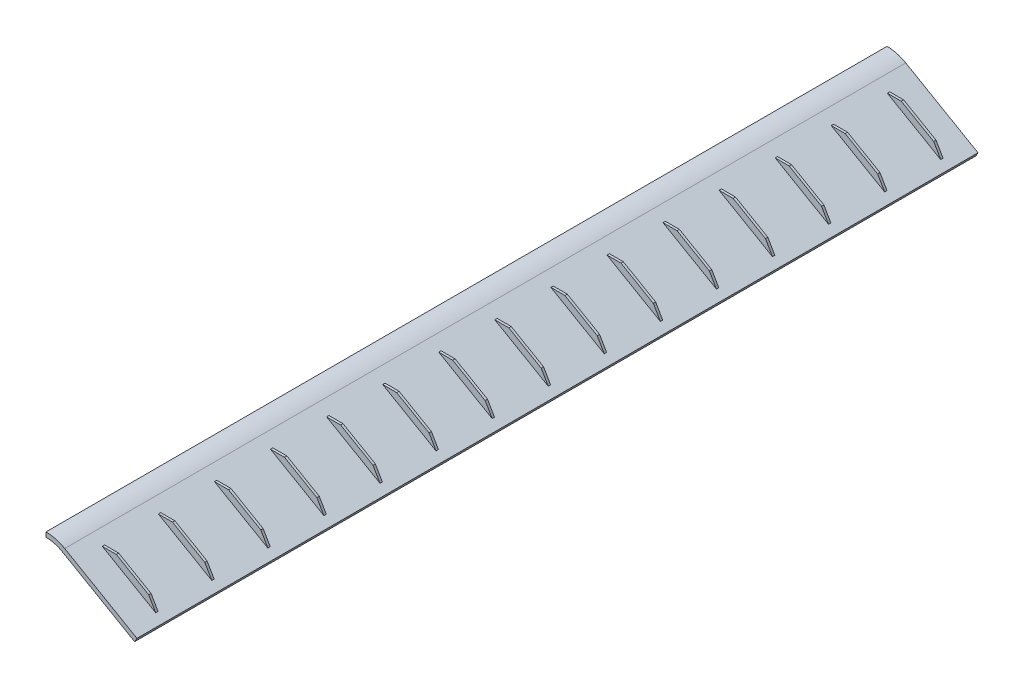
ISO-10303-21;
HEADER;
FILE_DESCRIPTION(('STEP AP214'),'2;1');
FILE_NAME('part.step','',(''),(''),'','','');
FILE_SCHEMA(('AUTOMOTIVE_DESIGN { 1 0 10303 214 1 1 1 1 }'));
ENDSEC;
DATA;
#1=APPLICATION_CONTEXT('core data for automotive mechanical design processes');
#2=APPLICATION_PROTOCOL_DEFINITION('international standard','automotive_design',2000,#1);
#3=PRODUCT_CONTEXT('',#1,'mechanical');
#4=PRODUCT('Part','Part','',(#3));
#5=PRODUCT_RELATED_PRODUCT_CATEGORY('part','',(#4));
#6=PRODUCT_DEFINITION_FORMATION('','',#4);
#7=PRODUCT_DEFINITION_CONTEXT('part definition',#1,'design');
#8=PRODUCT_DEFINITION('design','',#6,#7);
#9=PRODUCT_DEFINITION_SHAPE('','',#8);
#10=(LENGTH_UNIT() NAMED_UNIT(*) SI_UNIT(.MILLI.,.METRE.));
#11=(NAMED_UNIT(*) PLANE_ANGLE_UNIT() SI_UNIT($,.RADIAN.));
#12=(NAMED_UNIT(*) SI_UNIT($,.STERADIAN.) SOLID_ANGLE_UNIT());
#13=UNCERTAINTY_MEASURE_WITH_UNIT(LENGTH_MEASURE(1.E-05),#10,'distance_accuracy_value','');
#14=(GEOMETRIC_REPRESENTATION_CONTEXT(3) GLOBAL_UNCERTAINTY_ASSIGNED_CONTEXT((#13)) GLOBAL_UNIT_ASSIGNED_CONTEXT((#10,
#11,#12)) REPRESENTATION_CONTEXT('',''));
#15=CARTESIAN_POINT('',(0.,0.,0.));
#16=DIRECTION('',(0.,0.,1.));
#17=DIRECTION('',(1.,0.,0.));
#18=AXIS2_PLACEMENT_3D('',#15,#16,#17);
#19=CARTESIAN_POINT('',(3.50000000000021,-1.93782217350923,90.));
#20=DIRECTION('',(0.500000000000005,0.866025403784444,0.));
#21=DIRECTION('',(-0.866025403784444,0.500000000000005,0.));
#22=AXIS2_PLACEMENT_3D('',#19,#20,#21);
#23=PLANE('',#22);
#24=DIRECTION('',(0.866025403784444,-0.500000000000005,0.));
#25=VECTOR('',#24,1.);
#26=CARTESIAN_POINT('',(3.50000000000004,-1.93782217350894,-90.));
#27=LINE('',#26,#25);
#28=CARTESIAN_POINT('',(3.50000000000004,-1.93782217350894,-90.));
#29=VERTEX_POINT('',#28);
#30=CARTESIAN_POINT('',(18.9641016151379,-10.8660254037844,-90.));
#31=VERTEX_POINT('',#30);
#32=EDGE_CURVE('E904',#29,#31,#27,.T.);
#33=ORIENTED_EDGE('',*,*,#32,.T.);
#34=DIRECTION('',(0.,0.,-1.));
#35=VECTOR('',#34,1.);
#36=CARTESIAN_POINT('',(18.9641016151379,-10.8660254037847,90.));
#37=LINE('',#36,#35);
#38=CARTESIAN_POINT('',(18.9641016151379,-10.8660254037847,90.));
#39=VERTEX_POINT('',#38);
#40=EDGE_CURVE('E11',#39,#31,#37,.T.);
#41=ORIENTED_EDGE('',*,*,#40,.F.);
#42=DIRECTION('',(0.866025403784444,-0.500000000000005,0.));
#43=VECTOR('',#42,1.);
#44=CARTESIAN_POINT('',(3.50000000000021,-1.93782217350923,90.));
#45=LINE('',#44,#43);
#46=CARTESIAN_POINT('',(3.50000000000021,-1.93782217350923,90.));
#47=VERTEX_POINT('',#46);
#48=EDGE_CURVE('E921',#47,#39,#45,.T.);
#49=ORIENTED_EDGE('',*,*,#48,.F.);
#50=DIRECTION('',(0.,0.,-1.));
#51=VECTOR('',#50,1.);
#52=CARTESIAN_POINT('',(3.50000000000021,-1.93782217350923,90.));
#53=LINE('',#52,#51);
#54=EDGE_CURVE('E937',#47,#29,#53,.T.);
#55=ORIENTED_EDGE('',*,*,#54,.T.);
#56=EDGE_LOOP('',(#33,#41,#49,#55));
#57=FACE_BOUND('',#56,.T.);
#58=ADVANCED_FACE('F32',(#57),#23,.F.);
#59=CARTESIAN_POINT('',(19.464101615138,-10.0000000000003,90.));
#60=DIRECTION('',(0.866025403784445,-0.500000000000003,0.));
#61=DIRECTION('',(0.500000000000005,0.866025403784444,0.));
#62=AXIS2_PLACEMENT_3D('',#59,#60,#61);
#63=PLANE('',#62);
#64=DIRECTION('',(-0.500000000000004,-0.866025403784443,0.));
#65=VECTOR('',#64,1.);
#66=CARTESIAN_POINT('',(19.4641016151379,-9.99999999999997,-90.));
#67=LINE('',#66,#65);
#68=CARTESIAN_POINT('',(19.4641016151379,-9.99999999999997,-90.));
#69=VERTEX_POINT('',#68);
#70=EDGE_CURVE('E907',#69,#31,#67,.T.);
#71=ORIENTED_EDGE('',*,*,#70,.F.);
#72=DIRECTION('',(0.,0.,-1.));
#73=VECTOR('',#72,1.);
#74=CARTESIAN_POINT('',(19.464101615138,-10.0000000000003,90.));
#75=LINE('',#74,#73);
#76=CARTESIAN_POINT('',(19.464101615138,-10.0000000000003,90.));
#77=VERTEX_POINT('',#76);
#78=EDGE_CURVE('E39',#77,#69,#75,.T.);
#79=ORIENTED_EDGE('',*,*,#78,.F.);
#80=DIRECTION('',(-0.500000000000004,-0.866025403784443,0.));
#81=VECTOR('',#80,1.);
#82=CARTESIAN_POINT('',(19.464101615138,-10.0000000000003,90.));
#83=LINE('',#82,#81);
#84=EDGE_CURVE('E923',#77,#39,#83,.T.);
#85=ORIENTED_EDGE('',*,*,#84,.T.);
#86=ORIENTED_EDGE('',*,*,#40,.T.);
#87=EDGE_LOOP('',(#71,#79,#85,#86));
#88=FACE_BOUND('',#87,.T.);
#89=ADVANCED_FACE('F952',(#88),#63,.T.);
#90=CARTESIAN_POINT('',(4.00000000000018,-1.0717967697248,90.));
#91=DIRECTION('',(0.500000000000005,0.866025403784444,0.));
#92=DIRECTION('',(-0.866025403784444,0.500000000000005,0.));
#93=AXIS2_PLACEMENT_3D('',#90,#91,#92);
#94=PLANE('',#93);
#95=DIRECTION('',(0.866025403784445,-0.5,0.));
#96=VECTOR('',#95,1.);
#97=CARTESIAN_POINT('',(6.30384757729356,-2.40192378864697,83.75));
#98=LINE('',#97,#96);
#99=CARTESIAN_POINT('',(6.30384757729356,-2.40192378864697,83.75));
#100=VERTEX_POINT('',#99);
#101=CARTESIAN_POINT('',(17.7320508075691,-9.00000000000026,83.75));
#102=VERTEX_POINT('',#101);
#103=EDGE_CURVE('E466',#100,#102,#98,.T.);
#104=ORIENTED_EDGE('',*,*,#103,.T.);
#105=DIRECTION('',(0.,0.,1.));
#106=VECTOR('',#105,1.);
#107=CARTESIAN_POINT('',(17.7320508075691,-9.00000000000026,83.75));
#108=LINE('',#107,#106);
#109=CARTESIAN_POINT('',(17.7320508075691,-9.00000000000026,84.25));
#110=VERTEX_POINT('',#109);
#111=EDGE_CURVE('E478',#102,#110,#108,.T.);
#112=ORIENTED_EDGE('',*,*,#111,.T.);
#113=DIRECTION('',(0.866025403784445,-0.5,0.));
#114=VECTOR('',#113,1.);
#115=CARTESIAN_POINT('',(6.30384757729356,-2.40192378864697,84.25));
#116=LINE('',#115,#114);
#117=CARTESIAN_POINT('',(6.30384757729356,-2.40192378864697,84.25));
#118=VERTEX_POINT('',#117);
#119=EDGE_CURVE('E460',#118,#110,#116,.T.);
#120=ORIENTED_EDGE('',*,*,#119,.F.);
#121=DIRECTION('',(0.,0.,1.));
#122=VECTOR('',#121,1.);
#123=CARTESIAN_POINT('',(6.30384757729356,-2.40192378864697,83.75));
#124=LINE('',#123,#122);
#125=EDGE_CURVE('E454',#100,#118,#124,.T.);
#126=ORIENTED_EDGE('',*,*,#125,.F.);
#127=EDGE_LOOP('',(#104,#112,#120,#126));
#128=FACE_BOUND('',#127,.T.);
#129=DIRECTION('',(0.866025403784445,-0.5,0.));
#130=VECTOR('',#129,1.);
#131=CARTESIAN_POINT('',(6.3038475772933,-2.40192378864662,71.75));
#132=LINE('',#131,#130);
#133=CARTESIAN_POINT('',(6.3038475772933,-2.40192378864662,71.75));
#134=VERTEX_POINT('',#133);
#135=CARTESIAN_POINT('',(17.732050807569,-9.00000000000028,71.75));
#136=VERTEX_POINT('',#135);
#137=EDGE_CURVE('E491',#134,#136,#132,.T.);
#138=ORIENTED_EDGE('',*,*,#137,.T.);
#139=DIRECTION('',(0.,0.,1.));
#140=VECTOR('',#139,1.);
#141=CARTESIAN_POINT('',(17.732050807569,-9.00000000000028,71.75));
#142=LINE('',#141,#140);
#143=CARTESIAN_POINT('',(17.732050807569,-9.00000000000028,72.25));
#144=VERTEX_POINT('',#143);
#145=EDGE_CURVE('E503',#136,#144,#142,.T.);
#146=ORIENTED_EDGE('',*,*,#145,.T.);
#147=DIRECTION('',(0.866025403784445,-0.5,0.));
#148=VECTOR('',#147,1.);
#149=CARTESIAN_POINT('',(6.3038475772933,-2.40192378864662,72.25));
#150=LINE('',#149,#148);
#151=CARTESIAN_POINT('',(6.3038475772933,-2.40192378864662,72.25));
#152=VERTEX_POINT('',#151);
#153=EDGE_CURVE('E483',#152,#144,#150,.T.);
#154=ORIENTED_EDGE('',*,*,#153,.F.);
#155=DIRECTION('',(0.,0.,1.));
#156=VECTOR('',#155,1.);
#157=CARTESIAN_POINT('',(6.3038475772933,-2.40192378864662,71.75));
#158=LINE('',#157,#156);
#159=EDGE_CURVE('E510',#134,#152,#158,.T.);
#160=ORIENTED_EDGE('',*,*,#159,.F.);
#161=EDGE_LOOP('',(#138,#146,#154,#160));
#162=FACE_BOUND('',#161,.T.);
#163=DIRECTION('',(0.866025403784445,-0.5,0.));
#164=VECTOR('',#163,1.);
#165=CARTESIAN_POINT('',(6.30384757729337,-2.40192378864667,59.75));
#166=LINE('',#165,#164);
#167=CARTESIAN_POINT('',(6.30384757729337,-2.40192378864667,59.75));
#168=VERTEX_POINT('',#167);
#169=CARTESIAN_POINT('',(17.7320508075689,-8.99999999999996,59.7499999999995));
#170=VERTEX_POINT('',#169);
#171=EDGE_CURVE('E522',#168,#170,#166,.T.);
#172=ORIENTED_EDGE('',*,*,#171,.T.);
#173=DIRECTION('',(0.,0.,1.));
#174=VECTOR('',#173,1.);
#175=CARTESIAN_POINT('',(17.7320508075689,-8.99999999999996,59.7499999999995));
#176=LINE('',#175,#174);
#177=CARTESIAN_POINT('',(17.7320508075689,-8.99999999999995,60.2499999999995));
#178=VERTEX_POINT('',#177);
#179=EDGE_CURVE('E534',#170,#178,#176,.T.);
#180=ORIENTED_EDGE('',*,*,#179,.T.);
#181=DIRECTION('',(0.866025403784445,-0.5,0.));
#182=VECTOR('',#181,1.);
#183=CARTESIAN_POINT('',(6.30384757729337,-2.40192378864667,60.25));
#184=LINE('',#183,#182);
#185=CARTESIAN_POINT('',(6.30384757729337,-2.40192378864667,60.25));
#186=VERTEX_POINT('',#185);
#187=EDGE_CURVE('E512',#186,#178,#184,.T.);
#188=ORIENTED_EDGE('',*,*,#187,.F.);
#189=DIRECTION('',(0.,0.,1.));
#190=VECTOR('',#189,1.);
#191=CARTESIAN_POINT('',(6.30384757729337,-2.40192378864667,59.75));
#192=LINE('',#191,#190);
#193=EDGE_CURVE('E541',#168,#186,#192,.T.);
#194=ORIENTED_EDGE('',*,*,#193,.F.);
#195=EDGE_LOOP('',(#172,#180,#188,#194));
#196=FACE_BOUND('',#195,.T.);
#197=DIRECTION('',(0.866025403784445,-0.5,0.));
#198=VECTOR('',#197,1.);
#199=CARTESIAN_POINT('',(6.30384757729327,-2.40192378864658,47.75));
#200=LINE('',#199,#198);
#201=CARTESIAN_POINT('',(6.30384757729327,-2.40192378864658,47.75));
#202=VERTEX_POINT('',#201);
#203=CARTESIAN_POINT('',(17.732050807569,-9.00000000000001,47.7499999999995));
#204=VERTEX_POINT('',#203);
#205=EDGE_CURVE('E554',#202,#204,#200,.T.);
#206=ORIENTED_EDGE('',*,*,#205,.T.);
#207=DIRECTION('',(0.,0.,1.));
#208=VECTOR('',#207,1.);
#209=CARTESIAN_POINT('',(17.732050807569,-9.00000000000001,47.7499999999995));
#210=LINE('',#209,#208);
#211=CARTESIAN_POINT('',(17.732050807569,-9.00000000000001,48.2499999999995));
#212=VERTEX_POINT('',#211);
#213=EDGE_CURVE('E566',#204,#212,#210,.T.);
#214=ORIENTED_EDGE('',*,*,#213,.T.);
#215=DIRECTION('',(0.866025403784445,-0.5,0.));
#216=VECTOR('',#215,1.);
#217=CARTESIAN_POINT('',(6.30384757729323,-2.4019237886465,48.25));
#218=LINE('',#217,#216);
#219=CARTESIAN_POINT('',(6.30384757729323,-2.4019237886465,48.25));
#220=VERTEX_POINT('',#219);
#221=EDGE_CURVE('E544',#220,#212,#218,.T.);
#222=ORIENTED_EDGE('',*,*,#221,.F.);
#223=DIRECTION('',(0.,0.,1.));
#224=VECTOR('',#223,1.);
#225=CARTESIAN_POINT('',(6.30384757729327,-2.40192378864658,47.75));
#226=LINE('',#225,#224);
#227=EDGE_CURVE('E573',#202,#220,#226,.T.);
#228=ORIENTED_EDGE('',*,*,#227,.F.);
#229=EDGE_LOOP('',(#206,#214,#222,#228));
#230=FACE_BOUND('',#229,.T.);
#231=DIRECTION('',(0.866025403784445,-0.5,0.));
#232=VECTOR('',#231,1.);
#233=CARTESIAN_POINT('',(6.30384757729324,-2.40192378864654,35.75));
#234=LINE('',#233,#232);
#235=CARTESIAN_POINT('',(6.30384757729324,-2.40192378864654,35.75));
#236=VERTEX_POINT('',#235);
#237=CARTESIAN_POINT('',(17.7320508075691,-9.0000000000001,35.7499999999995));
#238=VERTEX_POINT('',#237);
#239=EDGE_CURVE('E586',#236,#238,#234,.T.);
#240=ORIENTED_EDGE('',*,*,#239,.T.);
#241=DIRECTION('',(0.,0.,1.));
#242=VECTOR('',#241,1.);
#243=CARTESIAN_POINT('',(17.7320508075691,-9.0000000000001,35.7499999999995));
#244=LINE('',#243,#242);
#245=CARTESIAN_POINT('',(17.7320508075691,-9.0000000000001,36.2499999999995));
#246=VERTEX_POINT('',#245);
#247=EDGE_CURVE('E598',#238,#246,#244,.T.);
#248=ORIENTED_EDGE('',*,*,#247,.T.);
#249=DIRECTION('',(0.866025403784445,-0.5,0.));
#250=VECTOR('',#249,1.);
#251=CARTESIAN_POINT('',(6.30384757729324,-2.40192378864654,36.25));
#252=LINE('',#251,#250);
#253=CARTESIAN_POINT('',(6.30384757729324,-2.40192378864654,36.25));
#254=VERTEX_POINT('',#253);
#255=EDGE_CURVE('E576',#254,#246,#252,.T.);
#256=ORIENTED_EDGE('',*,*,#255,.F.);
#257=DIRECTION('',(0.,0.,1.));
#258=VECTOR('',#257,1.);
#259=CARTESIAN_POINT('',(6.30384757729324,-2.40192378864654,35.75));
#260=LINE('',#259,#258);
#261=EDGE_CURVE('E605',#236,#254,#260,.T.);
#262=ORIENTED_EDGE('',*,*,#261,.F.);
#263=EDGE_LOOP('',(#240,#248,#256,#262));
#264=FACE_BOUND('',#263,.T.);
#265=DIRECTION('',(0.866025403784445,-0.5,0.));
#266=VECTOR('',#265,1.);
#267=CARTESIAN_POINT('',(6.30384757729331,-2.40192378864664,23.75));
#268=LINE('',#267,#266);
#269=CARTESIAN_POINT('',(6.30384757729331,-2.40192378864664,23.75));
#270=VERTEX_POINT('',#269);
#271=CARTESIAN_POINT('',(17.7320508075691,-9.00000000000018,23.7499999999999));
#272=VERTEX_POINT('',#271);
#273=EDGE_CURVE('E618',#270,#272,#268,.T.);
#274=ORIENTED_EDGE('',*,*,#273,.T.);
#275=DIRECTION('',(0.,0.,1.));
#276=VECTOR('',#275,1.);
#277=CARTESIAN_POINT('',(17.7320508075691,-9.00000000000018,23.7499999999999));
#278=LINE('',#277,#276);
#279=CARTESIAN_POINT('',(17.7320508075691,-9.00000000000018,24.2499999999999));
#280=VERTEX_POINT('',#279);
#281=EDGE_CURVE('E630',#272,#280,#278,.T.);
#282=ORIENTED_EDGE('',*,*,#281,.T.);
#283=DIRECTION('',(0.866025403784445,-0.5,0.));
#284=VECTOR('',#283,1.);
#285=CARTESIAN_POINT('',(6.30384757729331,-2.40192378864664,24.25));
#286=LINE('',#285,#284);
#287=CARTESIAN_POINT('',(6.30384757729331,-2.40192378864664,24.25));
#288=VERTEX_POINT('',#287);
#289=EDGE_CURVE('E608',#288,#280,#286,.T.);
#290=ORIENTED_EDGE('',*,*,#289,.F.);
#291=DIRECTION('',(0.,0.,1.));
#292=VECTOR('',#291,1.);
#293=CARTESIAN_POINT('',(6.30384757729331,-2.40192378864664,23.75));
#294=LINE('',#293,#292);
#295=EDGE_CURVE('E637',#270,#288,#294,.T.);
#296=ORIENTED_EDGE('',*,*,#295,.F.);
#297=EDGE_LOOP('',(#274,#282,#290,#296));
#298=FACE_BOUND('',#297,.T.);
#299=DIRECTION('',(0.866025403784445,-0.5,0.));
#300=VECTOR('',#299,1.);
#301=CARTESIAN_POINT('',(6.30384757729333,-2.40192378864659,11.7499999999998));
#302=LINE('',#301,#300);
#303=CARTESIAN_POINT('',(6.30384757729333,-2.40192378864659,11.7499999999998));
#304=VERTEX_POINT('',#303);
#305=CARTESIAN_POINT('',(17.7320508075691,-9.00000000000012,11.75));
#306=VERTEX_POINT('',#305);
#307=EDGE_CURVE('E650',#304,#306,#302,.T.);
#308=ORIENTED_EDGE('',*,*,#307,.T.);
#309=DIRECTION('',(0.,0.,1.));
#310=VECTOR('',#309,1.);
#311=CARTESIAN_POINT('',(17.7320508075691,-9.00000000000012,11.75));
#312=LINE('',#311,#310);
#313=CARTESIAN_POINT('',(17.7320508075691,-9.00000000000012,12.25));
#314=VERTEX_POINT('',#313);
#315=EDGE_CURVE('E662',#306,#314,#312,.T.);
#316=ORIENTED_EDGE('',*,*,#315,.T.);
#317=DIRECTION('',(0.866025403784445,-0.5,0.));
#318=VECTOR('',#317,1.);
#319=CARTESIAN_POINT('',(6.30384757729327,-2.40192378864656,12.2499999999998));
#320=LINE('',#319,#318);
#321=CARTESIAN_POINT('',(6.30384757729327,-2.40192378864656,12.2499999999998));
#322=VERTEX_POINT('',#321);
#323=EDGE_CURVE('E640',#322,#314,#320,.T.);
#324=ORIENTED_EDGE('',*,*,#323,.F.);
#325=DIRECTION('',(0.,0.,1.));
#326=VECTOR('',#325,1.);
#327=CARTESIAN_POINT('',(6.30384757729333,-2.40192378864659,11.7499999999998));
#328=LINE('',#327,#326);
#329=EDGE_CURVE('E669',#304,#322,#328,.T.);
#330=ORIENTED_EDGE('',*,*,#329,.F.);
#331=EDGE_LOOP('',(#308,#316,#324,#330));
#332=FACE_BOUND('',#331,.T.);
#333=DIRECTION('',(0.866025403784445,-0.5,0.));
#334=VECTOR('',#333,1.);
#335=CARTESIAN_POINT('',(6.30384757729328,-2.40192378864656,-83.75));
#336=LINE('',#335,#334);
#337=CARTESIAN_POINT('',(6.30384757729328,-2.40192378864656,-83.75));
#338=VERTEX_POINT('',#337);
#339=CARTESIAN_POINT('',(17.732050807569,-8.99999999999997,-83.75));
#340=VERTEX_POINT('',#339);
#341=EDGE_CURVE('E681',#338,#340,#336,.T.);
#342=ORIENTED_EDGE('',*,*,#341,.F.);
#343=DIRECTION('',(0.,0.,-1.));
#344=VECTOR('',#343,1.);
#345=CARTESIAN_POINT('',(6.30384757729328,-2.40192378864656,-83.75));
#346=LINE('',#345,#344);
#347=CARTESIAN_POINT('',(6.30384757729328,-2.40192378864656,-84.25));
#348=VERTEX_POINT('',#347);
#349=EDGE_CURVE('E690',#338,#348,#346,.T.);
#350=ORIENTED_EDGE('',*,*,#349,.T.);
#351=DIRECTION('',(0.866025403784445,-0.5,0.));
#352=VECTOR('',#351,1.);
#353=CARTESIAN_POINT('',(6.30384757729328,-2.40192378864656,-84.25));
#354=LINE('',#353,#352);
#355=CARTESIAN_POINT('',(17.732050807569,-8.99999999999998,-84.2500000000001));
#356=VERTEX_POINT('',#355);
#357=EDGE_CURVE('E672',#348,#356,#354,.T.);
#358=ORIENTED_EDGE('',*,*,#357,.T.);
#359=DIRECTION('',(0.,0.,-1.));
#360=VECTOR('',#359,1.);
#361=CARTESIAN_POINT('',(17.732050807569,-8.99999999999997,-83.75));
#362=LINE('',#361,#360);
#363=EDGE_CURVE('E699',#340,#356,#362,.T.);
#364=ORIENTED_EDGE('',*,*,#363,.F.);
#365=EDGE_LOOP('',(#342,#350,#358,#364));
#366=FACE_BOUND('',#365,.T.);
#367=DIRECTION('',(0.866025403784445,-0.5,0.));
#368=VECTOR('',#367,1.);
#369=CARTESIAN_POINT('',(6.30384757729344,-2.40192378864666,-71.75));
#370=LINE('',#369,#368);
#371=CARTESIAN_POINT('',(6.30384757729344,-2.40192378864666,-71.75));
#372=VERTEX_POINT('',#371);
#373=CARTESIAN_POINT('',(17.7320508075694,-8.99999999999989,-71.7500000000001));
#374=VERTEX_POINT('',#373);
#375=EDGE_CURVE('E710',#372,#374,#370,.T.);
#376=ORIENTED_EDGE('',*,*,#375,.F.);
#377=DIRECTION('',(0.,0.,-1.));
#378=VECTOR('',#377,1.);
#379=CARTESIAN_POINT('',(6.30384757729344,-2.40192378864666,-71.75));
#380=LINE('',#379,#378);
#381=CARTESIAN_POINT('',(6.30384757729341,-2.40192378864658,-72.25));
#382=VERTEX_POINT('',#381);
#383=EDGE_CURVE('E719',#372,#382,#380,.T.);
#384=ORIENTED_EDGE('',*,*,#383,.T.);
#385=DIRECTION('',(0.866025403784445,-0.5,0.));
#386=VECTOR('',#385,1.);
#387=CARTESIAN_POINT('',(6.30384757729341,-2.40192378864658,-72.25));
#388=LINE('',#387,#386);
#389=CARTESIAN_POINT('',(17.7320508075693,-9.00000000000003,-72.2500000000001));
#390=VERTEX_POINT('',#389);
#391=EDGE_CURVE('E701',#382,#390,#388,.T.);
#392=ORIENTED_EDGE('',*,*,#391,.T.);
#393=DIRECTION('',(0.,0.,-1.));
#394=VECTOR('',#393,1.);
#395=CARTESIAN_POINT('',(17.7320508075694,-8.99999999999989,-71.7500000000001));
#396=LINE('',#395,#394);
#397=EDGE_CURVE('E728',#374,#390,#396,.T.);
#398=ORIENTED_EDGE('',*,*,#397,.F.);
#399=EDGE_LOOP('',(#376,#384,#392,#398));
#400=FACE_BOUND('',#399,.T.);
#401=DIRECTION('',(0.866025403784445,-0.5,0.));
#402=VECTOR('',#401,1.);
#403=CARTESIAN_POINT('',(6.3038475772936,-2.40192378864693,-59.75));
#404=LINE('',#403,#402);
#405=CARTESIAN_POINT('',(6.3038475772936,-2.40192378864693,-59.75));
#406=VERTEX_POINT('',#405);
#407=CARTESIAN_POINT('',(17.7320508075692,-9.00000000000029,-59.75));
#408=VERTEX_POINT('',#407);
#409=EDGE_CURVE('E739',#406,#408,#404,.T.);
#410=ORIENTED_EDGE('',*,*,#409,.F.);
#411=DIRECTION('',(0.,0.,-1.));
#412=VECTOR('',#411,1.);
#413=CARTESIAN_POINT('',(6.3038475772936,-2.40192378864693,-59.75));
#414=LINE('',#413,#412);
#415=CARTESIAN_POINT('',(6.30384757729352,-2.40192378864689,-60.25));
#416=VERTEX_POINT('',#415);
#417=EDGE_CURVE('E748',#406,#416,#414,.T.);
#418=ORIENTED_EDGE('',*,*,#417,.T.);
#419=DIRECTION('',(0.866025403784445,-0.5,0.));
#420=VECTOR('',#419,1.);
#421=CARTESIAN_POINT('',(6.30384757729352,-2.40192378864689,-60.25));
#422=LINE('',#421,#420);
#423=CARTESIAN_POINT('',(17.7320508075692,-9.00000000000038,-60.25));
#424=VERTEX_POINT('',#423);
#425=EDGE_CURVE('E730',#416,#424,#422,.T.);
#426=ORIENTED_EDGE('',*,*,#425,.T.);
#427=DIRECTION('',(0.,0.,-1.));
#428=VECTOR('',#427,1.);
#429=CARTESIAN_POINT('',(17.7320508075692,-9.00000000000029,-59.75));
#430=LINE('',#429,#428);
#431=EDGE_CURVE('E757',#408,#424,#430,.T.);
#432=ORIENTED_EDGE('',*,*,#431,.F.);
#433=EDGE_LOOP('',(#410,#418,#426,#432));
#434=FACE_BOUND('',#433,.T.);
#435=DIRECTION('',(0.866025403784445,-0.5,0.));
#436=VECTOR('',#435,1.);
#437=CARTESIAN_POINT('',(6.30384757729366,-2.40192378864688,-47.75));
#438=LINE('',#437,#436);
#439=CARTESIAN_POINT('',(6.30384757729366,-2.40192378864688,-47.75));
#440=VERTEX_POINT('',#439);
#441=CARTESIAN_POINT('',(17.7320508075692,-9.00000000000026,-47.7500000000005));
#442=VERTEX_POINT('',#441);
#443=EDGE_CURVE('E768',#440,#442,#438,.T.);
#444=ORIENTED_EDGE('',*,*,#443,.F.);
#445=DIRECTION('',(0.,0.,-1.));
#446=VECTOR('',#445,1.);
#447=CARTESIAN_POINT('',(6.30384757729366,-2.40192378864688,-47.75));
#448=LINE('',#447,#446);
#449=CARTESIAN_POINT('',(6.30384757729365,-2.40192378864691,-48.25));
#450=VERTEX_POINT('',#449);
#451=EDGE_CURVE('E777',#440,#450,#448,.T.);
#452=ORIENTED_EDGE('',*,*,#451,.T.);
#453=DIRECTION('',(0.866025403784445,-0.5,0.));
#454=VECTOR('',#453,1.);
#455=CARTESIAN_POINT('',(6.30384757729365,-2.40192378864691,-48.25));
#456=LINE('',#455,#454);
#457=CARTESIAN_POINT('',(17.7320508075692,-9.00000000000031,-48.2500000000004));
#458=VERTEX_POINT('',#457);
#459=EDGE_CURVE('E759',#450,#458,#456,.T.);
#460=ORIENTED_EDGE('',*,*,#459,.T.);
#461=DIRECTION('',(0.,0.,-1.));
#462=VECTOR('',#461,1.);
#463=CARTESIAN_POINT('',(17.7320508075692,-9.00000000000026,-47.7500000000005));
#464=LINE('',#463,#462);
#465=EDGE_CURVE('E786',#442,#458,#464,.T.);
#466=ORIENTED_EDGE('',*,*,#465,.F.);
#467=EDGE_LOOP('',(#444,#452,#460,#466));
#468=FACE_BOUND('',#467,.T.);
#469=DIRECTION('',(0.866025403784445,-0.5,0.));
#470=VECTOR('',#469,1.);
#471=CARTESIAN_POINT('',(6.30384757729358,-2.40192378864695,-35.75));
#472=LINE('',#471,#470);
#473=CARTESIAN_POINT('',(6.30384757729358,-2.40192378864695,-35.75));
#474=VERTEX_POINT('',#473);
#475=CARTESIAN_POINT('',(17.7320508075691,-9.00000000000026,-35.7500000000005));
#476=VERTEX_POINT('',#475);
#477=EDGE_CURVE('E797',#474,#476,#472,.T.);
#478=ORIENTED_EDGE('',*,*,#477,.F.);
#479=DIRECTION('',(0.,0.,-1.));
#480=VECTOR('',#479,1.);
#481=CARTESIAN_POINT('',(6.30384757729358,-2.40192378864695,-35.75));
#482=LINE('',#481,#480);
#483=CARTESIAN_POINT('',(6.30384757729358,-2.40192378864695,-36.25));
#484=VERTEX_POINT('',#483);
#485=EDGE_CURVE('E806',#474,#484,#482,.T.);
#486=ORIENTED_EDGE('',*,*,#485,.T.);
#487=DIRECTION('',(0.866025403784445,-0.5,0.));
#488=VECTOR('',#487,1.);
#489=CARTESIAN_POINT('',(6.30384757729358,-2.40192378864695,-36.25));
#490=LINE('',#489,#488);
#491=CARTESIAN_POINT('',(17.7320508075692,-9.00000000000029,-36.2500000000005));
#492=VERTEX_POINT('',#491);
#493=EDGE_CURVE('E788',#484,#492,#490,.T.);
#494=ORIENTED_EDGE('',*,*,#493,.T.);
#495=DIRECTION('',(0.,0.,-1.));
#496=VECTOR('',#495,1.);
#497=CARTESIAN_POINT('',(17.7320508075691,-9.00000000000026,-35.7500000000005));
#498=LINE('',#497,#496);
#499=EDGE_CURVE('E815',#476,#492,#498,.T.);
#500=ORIENTED_EDGE('',*,*,#499,.F.);
#501=EDGE_LOOP('',(#478,#486,#494,#500));
#502=FACE_BOUND('',#501,.T.);
#503=DIRECTION('',(0.866025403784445,-0.5,0.));
#504=VECTOR('',#503,1.);
#505=CARTESIAN_POINT('',(6.30384757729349,-2.40192378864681,-23.75));
#506=LINE('',#505,#504);
#507=CARTESIAN_POINT('',(6.30384757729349,-2.40192378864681,-23.75));
#508=VERTEX_POINT('',#507);
#509=CARTESIAN_POINT('',(17.7320508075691,-9.00000000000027,-23.7500000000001));
#510=VERTEX_POINT('',#509);
#511=EDGE_CURVE('E826',#508,#510,#506,.T.);
#512=ORIENTED_EDGE('',*,*,#511,.F.);
#513=DIRECTION('',(0.,0.,-1.));
#514=VECTOR('',#513,1.);
#515=CARTESIAN_POINT('',(6.30384757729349,-2.40192378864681,-23.75));
#516=LINE('',#515,#514);
#517=CARTESIAN_POINT('',(6.30384757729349,-2.40192378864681,-24.25));
#518=VERTEX_POINT('',#517);
#519=EDGE_CURVE('E835',#508,#518,#516,.T.);
#520=ORIENTED_EDGE('',*,*,#519,.T.);
#521=DIRECTION('',(0.866025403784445,-0.5,0.));
#522=VECTOR('',#521,1.);
#523=CARTESIAN_POINT('',(6.30384757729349,-2.40192378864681,-24.25));
#524=LINE('',#523,#522);
#525=CARTESIAN_POINT('',(17.7320508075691,-9.00000000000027,-24.2500000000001));
#526=VERTEX_POINT('',#525);
#527=EDGE_CURVE('E817',#518,#526,#524,.T.);
#528=ORIENTED_EDGE('',*,*,#527,.T.);
#529=DIRECTION('',(0.,0.,-1.));
#530=VECTOR('',#529,1.);
#531=CARTESIAN_POINT('',(17.7320508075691,-9.00000000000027,-23.7500000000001));
#532=LINE('',#531,#530);
#533=EDGE_CURVE('E844',#510,#526,#532,.T.);
#534=ORIENTED_EDGE('',*,*,#533,.F.);
#535=EDGE_LOOP('',(#512,#520,#528,#534));
#536=FACE_BOUND('',#535,.T.);
#537=DIRECTION('',(0.866025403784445,-0.5,0.));
#538=VECTOR('',#537,1.);
#539=CARTESIAN_POINT('',(6.30384757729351,-2.40192378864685,-11.75));
#540=LINE('',#539,#538);
#541=CARTESIAN_POINT('',(6.30384757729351,-2.40192378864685,-11.75));
#542=VERTEX_POINT('',#541);
#543=CARTESIAN_POINT('',(17.7320508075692,-9.00000000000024,-11.75));
#544=VERTEX_POINT('',#543);
#545=EDGE_CURVE('E855',#542,#544,#540,.T.);
#546=ORIENTED_EDGE('',*,*,#545,.F.);
#547=DIRECTION('',(0.,0.,-1.));
#548=VECTOR('',#547,1.);
#549=CARTESIAN_POINT('',(6.30384757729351,-2.40192378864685,-11.75));
#550=LINE('',#549,#548);
#551=CARTESIAN_POINT('',(6.30384757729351,-2.40192378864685,-12.25));
#552=VERTEX_POINT('',#551);
#553=EDGE_CURVE('E864',#542,#552,#550,.T.);
#554=ORIENTED_EDGE('',*,*,#553,.T.);
#555=DIRECTION('',(0.866025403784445,-0.5,0.));
#556=VECTOR('',#555,1.);
#557=CARTESIAN_POINT('',(6.30384757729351,-2.40192378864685,-12.25));
#558=LINE('',#557,#556);
#559=CARTESIAN_POINT('',(17.7320508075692,-9.00000000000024,-12.25));
#560=VERTEX_POINT('',#559);
#561=EDGE_CURVE('E846',#552,#560,#558,.T.);
#562=ORIENTED_EDGE('',*,*,#561,.T.);
#563=DIRECTION('',(0.,0.,-1.));
#564=VECTOR('',#563,1.);
#565=CARTESIAN_POINT('',(17.7320508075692,-9.00000000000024,-11.75));
#566=LINE('',#565,#564);
#567=EDGE_CURVE('E873',#544,#560,#566,.T.);
#568=ORIENTED_EDGE('',*,*,#567,.F.);
#569=EDGE_LOOP('',(#546,#554,#562,#568));
#570=FACE_BOUND('',#569,.T.);
#571=DIRECTION('',(0.866025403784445,-0.5,0.));
#572=VECTOR('',#571,1.);
#573=CARTESIAN_POINT('',(6.30384757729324,-2.40192378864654,0.249999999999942));
#574=LINE('',#573,#572);
#575=CARTESIAN_POINT('',(6.30384757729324,-2.40192378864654,0.249999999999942));
#576=VERTEX_POINT('',#575);
#577=CARTESIAN_POINT('',(17.7320508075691,-9.00000000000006,0.25));
#578=VERTEX_POINT('',#577);
#579=EDGE_CURVE('E884',#576,#578,#574,.T.);
#580=ORIENTED_EDGE('',*,*,#579,.F.);
#581=DIRECTION('',(0.,0.,-1.));
#582=VECTOR('',#581,1.);
#583=CARTESIAN_POINT('',(6.30384757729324,-2.40192378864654,0.249999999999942));
#584=LINE('',#583,#582);
#585=CARTESIAN_POINT('',(6.30384757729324,-2.40192378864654,-0.250000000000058));
#586=VERTEX_POINT('',#585);
#587=EDGE_CURVE('E893',#576,#586,#584,.T.);
#588=ORIENTED_EDGE('',*,*,#587,.T.);
#589=DIRECTION('',(0.866025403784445,-0.5,0.));
#590=VECTOR('',#589,1.);
#591=CARTESIAN_POINT('',(6.30384757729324,-2.40192378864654,-0.250000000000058));
#592=LINE('',#591,#590);
#593=CARTESIAN_POINT('',(17.7320508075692,-9.00000000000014,-0.25));
#594=VERTEX_POINT('',#593);
#595=EDGE_CURVE('E875',#586,#594,#592,.T.);
#596=ORIENTED_EDGE('',*,*,#595,.T.);
#597=DIRECTION('',(0.,0.,-1.));
#598=VECTOR('',#597,1.);
#599=CARTESIAN_POINT('',(17.7320508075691,-9.00000000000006,0.25));
#600=LINE('',#599,#598);
#601=EDGE_CURVE('E902',#578,#594,#600,.T.);
#602=ORIENTED_EDGE('',*,*,#601,.F.);
#603=EDGE_LOOP('',(#580,#588,#596,#602));
#604=FACE_BOUND('',#603,.T.);
#605=DIRECTION('',(0.866025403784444,-0.500000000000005,0.));
#606=VECTOR('',#605,1.);
#607=CARTESIAN_POINT('',(4.,-1.07179676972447,-90.));
#608=LINE('',#607,#606);
#609=CARTESIAN_POINT('',(4.,-1.07179676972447,-90.));
#610=VERTEX_POINT('',#609);
#611=EDGE_CURVE('E910',#610,#69,#608,.T.);
#612=ORIENTED_EDGE('',*,*,#611,.F.);
#613=DIRECTION('',(0.,0.,-1.));
#614=VECTOR('',#613,1.);
#615=CARTESIAN_POINT('',(4.00000000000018,-1.0717967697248,90.));
#616=LINE('',#615,#614);
#617=CARTESIAN_POINT('',(4.00000000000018,-1.0717967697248,90.));
#618=VERTEX_POINT('',#617);
#619=EDGE_CURVE('E944',#618,#610,#616,.T.);
#620=ORIENTED_EDGE('',*,*,#619,.F.);
#621=DIRECTION('',(0.866025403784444,-0.500000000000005,0.));
#622=VECTOR('',#621,1.);
#623=CARTESIAN_POINT('',(4.00000000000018,-1.0717967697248,90.));
#624=LINE('',#623,#622);
#625=EDGE_CURVE('E926',#618,#77,#624,.T.);
#626=ORIENTED_EDGE('',*,*,#625,.T.);
#627=ORIENTED_EDGE('',*,*,#78,.T.);
#628=EDGE_LOOP('',(#612,#620,#626,#627));
#629=FACE_BOUND('',#628,.T.);
#630=ADVANCED_FACE('F948',(#128,#162,#196,#230,#264,#298,#332,#366,#400,#434,#468,#502,#536,
#570,#604,#629),#94,.T.);
#631=CARTESIAN_POINT('',(1.94289029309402E-13,-8.00000000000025,90.));
#632=DIRECTION('',(0.,0.,-1.));
#633=DIRECTION('',(-1.00000000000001,0.,0.));
#634=AXIS2_PLACEMENT_3D('',#631,#632,#633);
#635=CYLINDRICAL_SURFACE('',#634,8.);
#636=CARTESIAN_POINT('',(0.,-8.00000000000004,-90.));
#637=DIRECTION('',(0.,0.,-1.));
#638=DIRECTION('',(-1.00000000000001,0.,0.));
#639=AXIS2_PLACEMENT_3D('',#636,#637,#638);
#640=CIRCLE('',#639,8.);
#641=CARTESIAN_POINT('',(0.,0.,-90.));
#642=VERTEX_POINT('',#641);
#643=EDGE_CURVE('E913',#642,#610,#640,.T.);
#644=ORIENTED_EDGE('',*,*,#643,.F.);
#645=DIRECTION('',(0.,0.,-1.));
#646=VECTOR('',#645,1.);
#647=CARTESIAN_POINT('',(0.,0.,90.));
#648=LINE('',#647,#646);
#649=CARTESIAN_POINT('',(0.,0.,90.));
#650=VERTEX_POINT('',#649);
#651=EDGE_CURVE('E942',#650,#642,#648,.T.);
#652=ORIENTED_EDGE('',*,*,#651,.F.);
#653=CARTESIAN_POINT('',(1.94289029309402E-13,-8.00000000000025,90.));
#654=DIRECTION('',(0.,0.,-1.));
#655=DIRECTION('',(-1.00000000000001,0.,0.));
#656=AXIS2_PLACEMENT_3D('',#653,#654,#655);
#657=CIRCLE('',#656,8.);
#658=EDGE_CURVE('E929',#650,#618,#657,.T.);
#659=ORIENTED_EDGE('',*,*,#658,.T.);
#660=ORIENTED_EDGE('',*,*,#619,.T.);
#661=EDGE_LOOP('',(#644,#652,#659,#660));
#662=FACE_BOUND('',#661,.T.);
#663=ADVANCED_FACE('F961',(#662),#635,.T.);
#664=CARTESIAN_POINT('',(0.,-1.00000000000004,90.));
#665=DIRECTION('',(-1.00000000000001,0.,0.));
#666=DIRECTION('',(0.,-1.00000000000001,0.));
#667=AXIS2_PLACEMENT_3D('',#664,#665,#666);
#668=PLANE('',#667);
#669=DIRECTION('',(0.,1.00000000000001,0.));
#670=VECTOR('',#669,1.);
#671=CARTESIAN_POINT('',(0.,-0.999999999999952,-90.));
#672=LINE('',#671,#670);
#673=CARTESIAN_POINT('',(0.,-0.999999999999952,-90.));
#674=VERTEX_POINT('',#673);
#675=EDGE_CURVE('E916',#674,#642,#672,.T.);
#676=ORIENTED_EDGE('',*,*,#675,.F.);
#677=DIRECTION('',(0.,0.,-1.));
#678=VECTOR('',#677,1.);
#679=CARTESIAN_POINT('',(0.,-1.00000000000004,90.));
#680=LINE('',#679,#678);
#681=CARTESIAN_POINT('',(0.,-1.00000000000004,90.));
#682=VERTEX_POINT('',#681);
#683=EDGE_CURVE('E940',#682,#674,#680,.T.);
#684=ORIENTED_EDGE('',*,*,#683,.F.);
#685=DIRECTION('',(0.,1.00000000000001,0.));
#686=VECTOR('',#685,1.);
#687=CARTESIAN_POINT('',(0.,-1.00000000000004,90.));
#688=LINE('',#687,#686);
#689=EDGE_CURVE('E932',#682,#650,#688,.T.);
#690=ORIENTED_EDGE('',*,*,#689,.T.);
#691=ORIENTED_EDGE('',*,*,#651,.T.);
#692=EDGE_LOOP('',(#676,#684,#690,#691));
#693=FACE_BOUND('',#692,.T.);
#694=ADVANCED_FACE('F972',(#693),#668,.T.);
#695=CARTESIAN_POINT('',(1.94289029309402E-13,-8.00000000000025,90.));
#696=DIRECTION('',(0.,0.,-1.));
#697=DIRECTION('',(-1.00000000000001,0.,0.));
#698=AXIS2_PLACEMENT_3D('',#695,#696,#697);
#699=CYLINDRICAL_SURFACE('',#698,7.);
#700=CARTESIAN_POINT('',(0.,-8.00000000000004,-90.));
#701=DIRECTION('',(0.,0.,1.));
#702=DIRECTION('',(1.00000000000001,0.,0.));
#703=AXIS2_PLACEMENT_3D('',#700,#701,#702);
#704=CIRCLE('',#703,7.);
#705=EDGE_CURVE('E919',#674,#29,#704,.F.);
#706=ORIENTED_EDGE('',*,*,#705,.T.);
#707=ORIENTED_EDGE('',*,*,#54,.F.);
#708=CARTESIAN_POINT('',(1.94289029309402E-13,-8.00000000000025,90.));
#709=DIRECTION('',(0.,0.,1.));
#710=DIRECTION('',(1.00000000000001,0.,0.));
#711=AXIS2_PLACEMENT_3D('',#708,#709,#710);
#712=CIRCLE('',#711,7.);
#713=EDGE_CURVE('E935',#682,#47,#712,.F.);
#714=ORIENTED_EDGE('',*,*,#713,.F.);
#715=ORIENTED_EDGE('',*,*,#683,.T.);
#716=EDGE_LOOP('',(#706,#707,#714,#715));
#717=FACE_BOUND('',#716,.T.);
#718=ADVANCED_FACE('F973',(#717),#699,.F.);
#719=CARTESIAN_POINT('',(1.94289029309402E-13,-8.00000000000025,90.));
#720=DIRECTION('',(0.,0.,-1.));
#721=DIRECTION('',(-1.00000000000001,0.,0.));
#722=AXIS2_PLACEMENT_3D('',#719,#720,#721);
#723=PLANE('',#722);
#724=ORIENTED_EDGE('',*,*,#48,.T.);
#725=ORIENTED_EDGE('',*,*,#84,.F.);
#726=ORIENTED_EDGE('',*,*,#625,.F.);
#727=ORIENTED_EDGE('',*,*,#658,.F.);
#728=ORIENTED_EDGE('',*,*,#689,.F.);
#729=ORIENTED_EDGE('',*,*,#713,.T.);
#730=EDGE_LOOP('',(#724,#725,#726,#727,#728,#729));
#731=FACE_BOUND('',#730,.T.);
#732=ADVANCED_FACE('F964',(#731),#723,.F.);
#733=CARTESIAN_POINT('',(0.,-8.00000000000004,-90.));
#734=DIRECTION('',(0.,0.,-1.));
#735=DIRECTION('',(-1.00000000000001,0.,0.));
#736=AXIS2_PLACEMENT_3D('',#733,#734,#735);
#737=PLANE('',#736);
#738=ORIENTED_EDGE('',*,*,#32,.F.);
#739=ORIENTED_EDGE('',*,*,#705,.F.);
#740=ORIENTED_EDGE('',*,*,#675,.T.);
#741=ORIENTED_EDGE('',*,*,#643,.T.);
#742=ORIENTED_EDGE('',*,*,#611,.T.);
#743=ORIENTED_EDGE('',*,*,#70,.T.);
#744=EDGE_LOOP('',(#738,#739,#740,#741,#742,#743));
#745=FACE_BOUND('',#744,.T.);
#746=ADVANCED_FACE('F956',(#745),#737,.T.);
#747=CARTESIAN_POINT('',(16.2320508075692,-6.40192378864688,0.249999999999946));
#748=DIRECTION('',(-0.866025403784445,-0.500000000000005,0.));
#749=DIRECTION('',(0.500000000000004,-0.866025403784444,0.));
#750=AXIS2_PLACEMENT_3D('',#747,#748,#749);
#751=PLANE('',#750);
#752=DIRECTION('',(-0.500000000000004,0.866025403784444,0.));
#753=VECTOR('',#752,1.);
#754=CARTESIAN_POINT('',(16.2320508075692,-6.40192378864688,-0.250000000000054));
#755=LINE('',#754,#753);
#756=CARTESIAN_POINT('',(16.2320508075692,-6.40192378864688,-0.250000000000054));
#757=VERTEX_POINT('',#756);
#758=EDGE_CURVE('E878',#594,#757,#755,.T.);
#759=ORIENTED_EDGE('',*,*,#758,.T.);
#760=DIRECTION('',(0.,0.,-1.));
#761=VECTOR('',#760,1.);
#762=CARTESIAN_POINT('',(16.2320508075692,-6.40192378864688,0.249999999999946));
#763=LINE('',#762,#761);
#764=CARTESIAN_POINT('',(16.2320508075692,-6.40192378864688,0.249999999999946));
#765=VERTEX_POINT('',#764);
#766=EDGE_CURVE('E899',#765,#757,#763,.T.);
#767=ORIENTED_EDGE('',*,*,#766,.F.);
#768=DIRECTION('',(-0.500000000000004,0.866025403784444,0.));
#769=VECTOR('',#768,1.);
#770=CARTESIAN_POINT('',(16.2320508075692,-6.40192378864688,0.249999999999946));
#771=LINE('',#770,#769);
#772=EDGE_CURVE('E887',#578,#765,#771,.T.);
#773=ORIENTED_EDGE('',*,*,#772,.F.);
#774=ORIENTED_EDGE('',*,*,#601,.T.);
#775=EDGE_LOOP('',(#759,#767,#773,#774));
#776=FACE_BOUND('',#775,.T.);
#777=ADVANCED_FACE('F1020',(#776),#751,.F.);
#778=CARTESIAN_POINT('',(9.30384757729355,-2.40192378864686,0.249999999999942));
#779=DIRECTION('',(-0.500000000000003,-0.866025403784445,0.));
#780=DIRECTION('',(0.866025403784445,-0.500000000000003,0.));
#781=AXIS2_PLACEMENT_3D('',#778,#779,#780);
#782=PLANE('',#781);
#783=DIRECTION('',(-0.866025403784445,0.500000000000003,0.));
#784=VECTOR('',#783,1.);
#785=CARTESIAN_POINT('',(9.30384757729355,-2.40192378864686,-0.250000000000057));
#786=LINE('',#785,#784);
#787=CARTESIAN_POINT('',(9.30384757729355,-2.40192378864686,-0.250000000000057));
#788=VERTEX_POINT('',#787);
#789=EDGE_CURVE('E880',#757,#788,#786,.T.);
#790=ORIENTED_EDGE('',*,*,#789,.T.);
#791=DIRECTION('',(0.,0.,-1.));
#792=VECTOR('',#791,1.);
#793=CARTESIAN_POINT('',(9.30384757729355,-2.40192378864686,0.249999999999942));
#794=LINE('',#793,#792);
#795=CARTESIAN_POINT('',(9.30384757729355,-2.40192378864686,0.249999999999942));
#796=VERTEX_POINT('',#795);
#797=EDGE_CURVE('E896',#796,#788,#794,.T.);
#798=ORIENTED_EDGE('',*,*,#797,.F.);
#799=DIRECTION('',(-0.866025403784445,0.500000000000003,0.));
#800=VECTOR('',#799,1.);
#801=CARTESIAN_POINT('',(9.30384757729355,-2.40192378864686,0.249999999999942));
#802=LINE('',#801,#800);
#803=EDGE_CURVE('E889',#765,#796,#802,.T.);
#804=ORIENTED_EDGE('',*,*,#803,.F.);
#805=ORIENTED_EDGE('',*,*,#766,.T.);
#806=EDGE_LOOP('',(#790,#798,#804,#805));
#807=FACE_BOUND('',#806,.T.);
#808=ADVANCED_FACE('F1029',(#807),#782,.F.);
#809=CARTESIAN_POINT('',(6.30384757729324,-2.40192378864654,0.249999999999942));
#810=DIRECTION('',(0.,-1.00000000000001,0.));
#811=DIRECTION('',(1.00000000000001,0.,0.));
#812=AXIS2_PLACEMENT_3D('',#809,#810,#811);
#813=PLANE('',#812);
#814=DIRECTION('',(-1.00000000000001,0.,0.));
#815=VECTOR('',#814,1.);
#816=CARTESIAN_POINT('',(6.30384757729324,-2.40192378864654,-0.250000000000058));
#817=LINE('',#816,#815);
#818=EDGE_CURVE('E882',#788,#586,#817,.T.);
#819=ORIENTED_EDGE('',*,*,#818,.T.);
#820=ORIENTED_EDGE('',*,*,#587,.F.);
#821=DIRECTION('',(-1.00000000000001,0.,0.));
#822=VECTOR('',#821,1.);
#823=CARTESIAN_POINT('',(6.30384757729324,-2.40192378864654,0.249999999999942));
#824=LINE('',#823,#822);
#825=EDGE_CURVE('E891',#796,#576,#824,.T.);
#826=ORIENTED_EDGE('',*,*,#825,.F.);
#827=ORIENTED_EDGE('',*,*,#797,.T.);
#828=EDGE_LOOP('',(#819,#820,#826,#827));
#829=FACE_BOUND('',#828,.T.);
#830=ADVANCED_FACE('F1039',(#829),#813,.F.);
#831=CARTESIAN_POINT('',(6.30384757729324,-2.40192378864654,0.249999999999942));
#832=DIRECTION('',(0.,0.,1.));
#833=DIRECTION('',(1.00000000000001,0.,0.));
#834=AXIS2_PLACEMENT_3D('',#831,#832,#833);
#835=PLANE('',#834);
#836=ORIENTED_EDGE('',*,*,#579,.T.);
#837=ORIENTED_EDGE('',*,*,#772,.T.);
#838=ORIENTED_EDGE('',*,*,#803,.T.);
#839=ORIENTED_EDGE('',*,*,#825,.T.);
#840=EDGE_LOOP('',(#836,#837,#838,#839));
#841=FACE_BOUND('',#840,.T.);
#842=ADVANCED_FACE('F1049',(#841),#835,.T.);
#843=CARTESIAN_POINT('',(6.30384757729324,-2.40192378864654,-0.250000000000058));
#844=DIRECTION('',(0.,0.,1.));
#845=DIRECTION('',(1.00000000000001,0.,0.));
#846=AXIS2_PLACEMENT_3D('',#843,#844,#845);
#847=PLANE('',#846);
#848=ORIENTED_EDGE('',*,*,#595,.F.);
#849=ORIENTED_EDGE('',*,*,#818,.F.);
#850=ORIENTED_EDGE('',*,*,#789,.F.);
#851=ORIENTED_EDGE('',*,*,#758,.F.);
#852=EDGE_LOOP('',(#848,#849,#850,#851));
#853=FACE_BOUND('',#852,.T.);
#854=ADVANCED_FACE('F1059',(#853),#847,.F.);
#855=CARTESIAN_POINT('',(16.2320508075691,-6.40192378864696,-11.75));
#856=DIRECTION('',(-0.866025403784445,-0.500000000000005,0.));
#857=DIRECTION('',(0.500000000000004,-0.866025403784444,0.));
#858=AXIS2_PLACEMENT_3D('',#855,#856,#857);
#859=PLANE('',#858);
#860=DIRECTION('',(-0.500000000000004,0.866025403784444,0.));
#861=VECTOR('',#860,1.);
#862=CARTESIAN_POINT('',(16.2320508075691,-6.40192378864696,-12.25));
#863=LINE('',#862,#861);
#864=CARTESIAN_POINT('',(16.2320508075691,-6.40192378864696,-12.25));
#865=VERTEX_POINT('',#864);
#866=EDGE_CURVE('E849',#560,#865,#863,.T.);
#867=ORIENTED_EDGE('',*,*,#866,.T.);
#868=DIRECTION('',(0.,0.,-1.));
#869=VECTOR('',#868,1.);
#870=CARTESIAN_POINT('',(16.2320508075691,-6.40192378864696,-11.75));
#871=LINE('',#870,#869);
#872=CARTESIAN_POINT('',(16.2320508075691,-6.40192378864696,-11.75));
#873=VERTEX_POINT('',#872);
#874=EDGE_CURVE('E870',#873,#865,#871,.T.);
#875=ORIENTED_EDGE('',*,*,#874,.F.);
#876=DIRECTION('',(-0.500000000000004,0.866025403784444,0.));
#877=VECTOR('',#876,1.);
#878=CARTESIAN_POINT('',(16.2320508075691,-6.40192378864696,-11.75));
#879=LINE('',#878,#877);
#880=EDGE_CURVE('E858',#544,#873,#879,.T.);
#881=ORIENTED_EDGE('',*,*,#880,.F.);
#882=ORIENTED_EDGE('',*,*,#567,.T.);
#883=EDGE_LOOP('',(#867,#875,#881,#882));
#884=FACE_BOUND('',#883,.T.);
#885=ADVANCED_FACE('F1069',(#884),#859,.F.);
#886=CARTESIAN_POINT('',(9.30384757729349,-2.40192378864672,-11.75));
#887=DIRECTION('',(-0.500000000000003,-0.866025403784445,0.));
#888=DIRECTION('',(0.866025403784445,-0.500000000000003,0.));
#889=AXIS2_PLACEMENT_3D('',#886,#887,#888);
#890=PLANE('',#889);
#891=DIRECTION('',(-0.866025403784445,0.500000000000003,0.));
#892=VECTOR('',#891,1.);
#893=CARTESIAN_POINT('',(9.30384757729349,-2.40192378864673,-12.25));
#894=LINE('',#893,#892);
#895=CARTESIAN_POINT('',(9.30384757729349,-2.40192378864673,-12.25));
#896=VERTEX_POINT('',#895);
#897=EDGE_CURVE('E851',#865,#896,#894,.T.);
#898=ORIENTED_EDGE('',*,*,#897,.T.);
#899=DIRECTION('',(0.,0.,-1.));
#900=VECTOR('',#899,1.);
#901=CARTESIAN_POINT('',(9.30384757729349,-2.40192378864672,-11.75));
#902=LINE('',#901,#900);
#903=CARTESIAN_POINT('',(9.30384757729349,-2.40192378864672,-11.75));
#904=VERTEX_POINT('',#903);
#905=EDGE_CURVE('E867',#904,#896,#902,.T.);
#906=ORIENTED_EDGE('',*,*,#905,.F.);
#907=DIRECTION('',(-0.866025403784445,0.500000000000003,0.));
#908=VECTOR('',#907,1.);
#909=CARTESIAN_POINT('',(9.30384757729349,-2.40192378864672,-11.75));
#910=LINE('',#909,#908);
#911=EDGE_CURVE('E860',#873,#904,#910,.T.);
#912=ORIENTED_EDGE('',*,*,#911,.F.);
#913=ORIENTED_EDGE('',*,*,#874,.T.);
#914=EDGE_LOOP('',(#898,#906,#912,#913));
#915=FACE_BOUND('',#914,.T.);
#916=ADVANCED_FACE('F1079',(#915),#890,.F.);
#917=CARTESIAN_POINT('',(6.30384757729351,-2.40192378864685,-11.75));
#918=DIRECTION('',(0.,-1.00000000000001,0.));
#919=DIRECTION('',(1.00000000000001,0.,0.));
#920=AXIS2_PLACEMENT_3D('',#917,#918,#919);
#921=PLANE('',#920);
#922=DIRECTION('',(-1.00000000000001,0.,0.));
#923=VECTOR('',#922,1.);
#924=CARTESIAN_POINT('',(6.30384757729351,-2.40192378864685,-12.25));
#925=LINE('',#924,#923);
#926=EDGE_CURVE('E853',#896,#552,#925,.T.);
#927=ORIENTED_EDGE('',*,*,#926,.T.);
#928=ORIENTED_EDGE('',*,*,#553,.F.);
#929=DIRECTION('',(-1.00000000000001,0.,0.));
#930=VECTOR('',#929,1.);
#931=CARTESIAN_POINT('',(6.30384757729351,-2.40192378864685,-11.75));
#932=LINE('',#931,#930);
#933=EDGE_CURVE('E862',#904,#542,#932,.T.);
#934=ORIENTED_EDGE('',*,*,#933,.F.);
#935=ORIENTED_EDGE('',*,*,#905,.T.);
#936=EDGE_LOOP('',(#927,#928,#934,#935));
#937=FACE_BOUND('',#936,.T.);
#938=ADVANCED_FACE('F1089',(#937),#921,.F.);
#939=CARTESIAN_POINT('',(6.30384757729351,-2.40192378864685,-11.75));
#940=DIRECTION('',(0.,0.,1.));
#941=DIRECTION('',(1.00000000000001,0.,0.));
#942=AXIS2_PLACEMENT_3D('',#939,#940,#941);
#943=PLANE('',#942);
#944=ORIENTED_EDGE('',*,*,#545,.T.);
#945=ORIENTED_EDGE('',*,*,#880,.T.);
#946=ORIENTED_EDGE('',*,*,#911,.T.);
#947=ORIENTED_EDGE('',*,*,#933,.T.);
#948=EDGE_LOOP('',(#944,#945,#946,#947));
#949=FACE_BOUND('',#948,.T.);
#950=ADVANCED_FACE('F1099',(#949),#943,.T.);
#951=CARTESIAN_POINT('',(6.30384757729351,-2.40192378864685,-12.25));
#952=DIRECTION('',(0.,0.,1.));
#953=DIRECTION('',(1.00000000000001,0.,0.));
#954=AXIS2_PLACEMENT_3D('',#951,#952,#953);
#955=PLANE('',#954);
#956=ORIENTED_EDGE('',*,*,#561,.F.);
#957=ORIENTED_EDGE('',*,*,#926,.F.);
#958=ORIENTED_EDGE('',*,*,#897,.F.);
#959=ORIENTED_EDGE('',*,*,#866,.F.);
#960=EDGE_LOOP('',(#956,#957,#958,#959));
#961=FACE_BOUND('',#960,.T.);
#962=ADVANCED_FACE('F1109',(#961),#955,.F.);
#963=CARTESIAN_POINT('',(16.2320508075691,-6.40192378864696,-23.7500000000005));
#964=DIRECTION('',(-0.866025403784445,-0.500000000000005,0.));
#965=DIRECTION('',(0.500000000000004,-0.866025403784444,0.));
#966=AXIS2_PLACEMENT_3D('',#963,#964,#965);
#967=PLANE('',#966);
#968=DIRECTION('',(-0.500000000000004,0.866025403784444,0.));
#969=VECTOR('',#968,1.);
#970=CARTESIAN_POINT('',(16.2320508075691,-6.40192378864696,-24.2500000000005));
#971=LINE('',#970,#969);
#972=CARTESIAN_POINT('',(16.2320508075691,-6.40192378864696,-24.2500000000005));
#973=VERTEX_POINT('',#972);
#974=EDGE_CURVE('E820',#526,#973,#971,.T.);
#975=ORIENTED_EDGE('',*,*,#974,.T.);
#976=DIRECTION('',(0.,0.,-1.));
#977=VECTOR('',#976,1.);
#978=CARTESIAN_POINT('',(16.2320508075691,-6.40192378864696,-23.7500000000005));
#979=LINE('',#978,#977);
#980=CARTESIAN_POINT('',(16.2320508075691,-6.40192378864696,-23.7500000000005));
#981=VERTEX_POINT('',#980);
#982=EDGE_CURVE('E841',#981,#973,#979,.T.);
#983=ORIENTED_EDGE('',*,*,#982,.F.);
#984=DIRECTION('',(-0.500000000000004,0.866025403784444,0.));
#985=VECTOR('',#984,1.);
#986=CARTESIAN_POINT('',(16.2320508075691,-6.40192378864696,-23.7500000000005));
#987=LINE('',#986,#985);
#988=EDGE_CURVE('E829',#510,#981,#987,.T.);
#989=ORIENTED_EDGE('',*,*,#988,.F.);
#990=ORIENTED_EDGE('',*,*,#533,.T.);
#991=EDGE_LOOP('',(#975,#983,#989,#990));
#992=FACE_BOUND('',#991,.T.);
#993=ADVANCED_FACE('F1119',(#992),#967,.F.);
#994=CARTESIAN_POINT('',(9.30384757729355,-2.40192378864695,-23.75));
#995=DIRECTION('',(-0.500000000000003,-0.866025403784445,0.));
#996=DIRECTION('',(0.866025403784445,-0.500000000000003,0.));
#997=AXIS2_PLACEMENT_3D('',#994,#995,#996);
#998=PLANE('',#997);
#999=DIRECTION('',(-0.866025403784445,0.500000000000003,0.));
#1000=VECTOR('',#999,1.);
#1001=CARTESIAN_POINT('',(9.30384757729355,-2.40192378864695,-24.25));
#1002=LINE('',#1001,#1000);
#1003=CARTESIAN_POINT('',(9.30384757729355,-2.40192378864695,-24.25));
#1004=VERTEX_POINT('',#1003);
#1005=EDGE_CURVE('E822',#973,#1004,#1002,.T.);
#1006=ORIENTED_EDGE('',*,*,#1005,.T.);
#1007=DIRECTION('',(0.,0.,-1.));
#1008=VECTOR('',#1007,1.);
#1009=CARTESIAN_POINT('',(9.30384757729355,-2.40192378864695,-23.75));
#1010=LINE('',#1009,#1008);
#1011=CARTESIAN_POINT('',(9.30384757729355,-2.40192378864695,-23.75));
#1012=VERTEX_POINT('',#1011);
#1013=EDGE_CURVE('E838',#1012,#1004,#1010,.T.);
#1014=ORIENTED_EDGE('',*,*,#1013,.F.);
#1015=DIRECTION('',(-0.866025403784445,0.500000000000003,0.));
#1016=VECTOR('',#1015,1.);
#1017=CARTESIAN_POINT('',(9.30384757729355,-2.40192378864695,-23.75));
#1018=LINE('',#1017,#1016);
#1019=EDGE_CURVE('E831',#981,#1012,#1018,.T.);
#1020=ORIENTED_EDGE('',*,*,#1019,.F.);
#1021=ORIENTED_EDGE('',*,*,#982,.T.);
#1022=EDGE_LOOP('',(#1006,#1014,#1020,#1021));
#1023=FACE_BOUND('',#1022,.T.);
#1024=ADVANCED_FACE('F1129',(#1023),#998,.F.);
#1025=CARTESIAN_POINT('',(6.30384757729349,-2.40192378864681,-23.75));
#1026=DIRECTION('',(0.,-1.00000000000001,0.));
#1027=DIRECTION('',(1.00000000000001,0.,0.));
#1028=AXIS2_PLACEMENT_3D('',#1025,#1026,#1027);
#1029=PLANE('',#1028);
#1030=DIRECTION('',(-1.00000000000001,0.,0.));
#1031=VECTOR('',#1030,1.);
#1032=CARTESIAN_POINT('',(6.30384757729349,-2.40192378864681,-24.25));
#1033=LINE('',#1032,#1031);
#1034=EDGE_CURVE('E824',#1004,#518,#1033,.T.);
#1035=ORIENTED_EDGE('',*,*,#1034,.T.);
#1036=ORIENTED_EDGE('',*,*,#519,.F.);
#1037=DIRECTION('',(-1.00000000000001,0.,0.));
#1038=VECTOR('',#1037,1.);
#1039=CARTESIAN_POINT('',(6.30384757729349,-2.40192378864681,-23.75));
#1040=LINE('',#1039,#1038);
#1041=EDGE_CURVE('E833',#1012,#508,#1040,.T.);
#1042=ORIENTED_EDGE('',*,*,#1041,.F.);
#1043=ORIENTED_EDGE('',*,*,#1013,.T.);
#1044=EDGE_LOOP('',(#1035,#1036,#1042,#1043));
#1045=FACE_BOUND('',#1044,.T.);
#1046=ADVANCED_FACE('F1139',(#1045),#1029,.F.);
#1047=CARTESIAN_POINT('',(6.30384757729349,-2.40192378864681,-23.75));
#1048=DIRECTION('',(0.,0.,1.));
#1049=DIRECTION('',(1.00000000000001,0.,0.));
#1050=AXIS2_PLACEMENT_3D('',#1047,#1048,#1049);
#1051=PLANE('',#1050);
#1052=ORIENTED_EDGE('',*,*,#511,.T.);
#1053=ORIENTED_EDGE('',*,*,#988,.T.);
#1054=ORIENTED_EDGE('',*,*,#1019,.T.);
#1055=ORIENTED_EDGE('',*,*,#1041,.T.);
#1056=EDGE_LOOP('',(#1052,#1053,#1054,#1055));
#1057=FACE_BOUND('',#1056,.T.);
#1058=ADVANCED_FACE('F1149',(#1057),#1051,.T.);
#1059=CARTESIAN_POINT('',(6.30384757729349,-2.40192378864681,-24.25));
#1060=DIRECTION('',(0.,0.,1.));
#1061=DIRECTION('',(1.00000000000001,0.,0.));
#1062=AXIS2_PLACEMENT_3D('',#1059,#1060,#1061);
#1063=PLANE('',#1062);
#1064=ORIENTED_EDGE('',*,*,#527,.F.);
#1065=ORIENTED_EDGE('',*,*,#1034,.F.);
#1066=ORIENTED_EDGE('',*,*,#1005,.F.);
#1067=ORIENTED_EDGE('',*,*,#974,.F.);
#1068=EDGE_LOOP('',(#1064,#1065,#1066,#1067));
#1069=FACE_BOUND('',#1068,.T.);
#1070=ADVANCED_FACE('F1159',(#1069),#1063,.F.);
#1071=CARTESIAN_POINT('',(16.2320508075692,-6.40192378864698,-35.75));
#1072=DIRECTION('',(-0.866025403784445,-0.500000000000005,0.));
#1073=DIRECTION('',(0.500000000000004,-0.866025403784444,0.));
#1074=AXIS2_PLACEMENT_3D('',#1071,#1072,#1073);
#1075=PLANE('',#1074);
#1076=DIRECTION('',(-0.500000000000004,0.866025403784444,0.));
#1077=VECTOR('',#1076,1.);
#1078=CARTESIAN_POINT('',(16.2320508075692,-6.40192378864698,-36.25));
#1079=LINE('',#1078,#1077);
#1080=CARTESIAN_POINT('',(16.2320508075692,-6.40192378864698,-36.25));
#1081=VERTEX_POINT('',#1080);
#1082=EDGE_CURVE('E791',#492,#1081,#1079,.T.);
#1083=ORIENTED_EDGE('',*,*,#1082,.T.);
#1084=DIRECTION('',(0.,0.,-1.));
#1085=VECTOR('',#1084,1.);
#1086=CARTESIAN_POINT('',(16.2320508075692,-6.40192378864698,-35.75));
#1087=LINE('',#1086,#1085);
#1088=CARTESIAN_POINT('',(16.2320508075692,-6.40192378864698,-35.75));
#1089=VERTEX_POINT('',#1088);
#1090=EDGE_CURVE('E812',#1089,#1081,#1087,.T.);
#1091=ORIENTED_EDGE('',*,*,#1090,.F.);
#1092=DIRECTION('',(-0.500000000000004,0.866025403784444,0.));
#1093=VECTOR('',#1092,1.);
#1094=CARTESIAN_POINT('',(16.2320508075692,-6.40192378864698,-35.75));
#1095=LINE('',#1094,#1093);
#1096=EDGE_CURVE('E800',#476,#1089,#1095,.T.);
#1097=ORIENTED_EDGE('',*,*,#1096,.F.);
#1098=ORIENTED_EDGE('',*,*,#499,.T.);
#1099=EDGE_LOOP('',(#1083,#1091,#1097,#1098));
#1100=FACE_BOUND('',#1099,.T.);
#1101=ADVANCED_FACE('F1169',(#1100),#1075,.F.);
#1102=CARTESIAN_POINT('',(9.30384757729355,-2.40192378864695,-35.75));
#1103=DIRECTION('',(-0.500000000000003,-0.866025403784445,0.));
#1104=DIRECTION('',(0.866025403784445,-0.500000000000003,0.));
#1105=AXIS2_PLACEMENT_3D('',#1102,#1103,#1104);
#1106=PLANE('',#1105);
#1107=DIRECTION('',(-0.866025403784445,0.500000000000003,0.));
#1108=VECTOR('',#1107,1.);
#1109=CARTESIAN_POINT('',(9.30384757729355,-2.40192378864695,-36.25));
#1110=LINE('',#1109,#1108);
#1111=CARTESIAN_POINT('',(9.30384757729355,-2.40192378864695,-36.25));
#1112=VERTEX_POINT('',#1111);
#1113=EDGE_CURVE('E793',#1081,#1112,#1110,.T.);
#1114=ORIENTED_EDGE('',*,*,#1113,.T.);
#1115=DIRECTION('',(0.,0.,-1.));
#1116=VECTOR('',#1115,1.);
#1117=CARTESIAN_POINT('',(9.30384757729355,-2.40192378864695,-35.75));
#1118=LINE('',#1117,#1116);
#1119=CARTESIAN_POINT('',(9.30384757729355,-2.40192378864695,-35.75));
#1120=VERTEX_POINT('',#1119);
#1121=EDGE_CURVE('E809',#1120,#1112,#1118,.T.);
#1122=ORIENTED_EDGE('',*,*,#1121,.F.);
#1123=DIRECTION('',(-0.866025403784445,0.500000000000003,0.));
#1124=VECTOR('',#1123,1.);
#1125=CARTESIAN_POINT('',(9.30384757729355,-2.40192378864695,-35.75));
#1126=LINE('',#1125,#1124);
#1127=EDGE_CURVE('E802',#1089,#1120,#1126,.T.);
#1128=ORIENTED_EDGE('',*,*,#1127,.F.);
#1129=ORIENTED_EDGE('',*,*,#1090,.T.);
#1130=EDGE_LOOP('',(#1114,#1122,#1128,#1129));
#1131=FACE_BOUND('',#1130,.T.);
#1132=ADVANCED_FACE('F1179',(#1131),#1106,.F.);
#1133=CARTESIAN_POINT('',(6.30384757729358,-2.40192378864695,-35.75));
#1134=DIRECTION('',(0.,-1.00000000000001,0.));
#1135=DIRECTION('',(1.00000000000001,0.,0.));
#1136=AXIS2_PLACEMENT_3D('',#1133,#1134,#1135);
#1137=PLANE('',#1136);
#1138=DIRECTION('',(-1.00000000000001,0.,0.));
#1139=VECTOR('',#1138,1.);
#1140=CARTESIAN_POINT('',(6.30384757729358,-2.40192378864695,-36.25));
#1141=LINE('',#1140,#1139);
#1142=EDGE_CURVE('E795',#1112,#484,#1141,.T.);
#1143=ORIENTED_EDGE('',*,*,#1142,.T.);
#1144=ORIENTED_EDGE('',*,*,#485,.F.);
#1145=DIRECTION('',(-1.00000000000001,0.,0.));
#1146=VECTOR('',#1145,1.);
#1147=CARTESIAN_POINT('',(6.30384757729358,-2.40192378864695,-35.75));
#1148=LINE('',#1147,#1146);
#1149=EDGE_CURVE('E804',#1120,#474,#1148,.T.);
#1150=ORIENTED_EDGE('',*,*,#1149,.F.);
#1151=ORIENTED_EDGE('',*,*,#1121,.T.);
#1152=EDGE_LOOP('',(#1143,#1144,#1150,#1151));
#1153=FACE_BOUND('',#1152,.T.);
#1154=ADVANCED_FACE('F1189',(#1153),#1137,.F.);
#1155=CARTESIAN_POINT('',(6.30384757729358,-2.40192378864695,-35.75));
#1156=DIRECTION('',(0.,0.,1.));
#1157=DIRECTION('',(1.00000000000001,0.,0.));
#1158=AXIS2_PLACEMENT_3D('',#1155,#1156,#1157);
#1159=PLANE('',#1158);
#1160=ORIENTED_EDGE('',*,*,#477,.T.);
#1161=ORIENTED_EDGE('',*,*,#1096,.T.);
#1162=ORIENTED_EDGE('',*,*,#1127,.T.);
#1163=ORIENTED_EDGE('',*,*,#1149,.T.);
#1164=EDGE_LOOP('',(#1160,#1161,#1162,#1163));
#1165=FACE_BOUND('',#1164,.T.);
#1166=ADVANCED_FACE('F1199',(#1165),#1159,.T.);
#1167=CARTESIAN_POINT('',(6.30384757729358,-2.40192378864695,-36.25));
#1168=DIRECTION('',(0.,0.,1.));
#1169=DIRECTION('',(1.00000000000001,0.,0.));
#1170=AXIS2_PLACEMENT_3D('',#1167,#1168,#1169);
#1171=PLANE('',#1170);
#1172=ORIENTED_EDGE('',*,*,#493,.F.);
#1173=ORIENTED_EDGE('',*,*,#1142,.F.);
#1174=ORIENTED_EDGE('',*,*,#1113,.F.);
#1175=ORIENTED_EDGE('',*,*,#1082,.F.);
#1176=EDGE_LOOP('',(#1172,#1173,#1174,#1175));
#1177=FACE_BOUND('',#1176,.T.);
#1178=ADVANCED_FACE('F1209',(#1177),#1171,.F.);
#1179=CARTESIAN_POINT('',(16.2320508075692,-6.40192378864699,-47.75));
#1180=DIRECTION('',(-0.866025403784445,-0.500000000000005,0.));
#1181=DIRECTION('',(0.500000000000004,-0.866025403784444,0.));
#1182=AXIS2_PLACEMENT_3D('',#1179,#1180,#1181);
#1183=PLANE('',#1182);
#1184=DIRECTION('',(-0.500000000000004,0.866025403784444,0.));
#1185=VECTOR('',#1184,1.);
#1186=CARTESIAN_POINT('',(16.2320508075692,-6.40192378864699,-48.25));
#1187=LINE('',#1186,#1185);
#1188=CARTESIAN_POINT('',(16.2320508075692,-6.40192378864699,-48.25));
#1189=VERTEX_POINT('',#1188);
#1190=EDGE_CURVE('E762',#458,#1189,#1187,.T.);
#1191=ORIENTED_EDGE('',*,*,#1190,.T.);
#1192=DIRECTION('',(0.,0.,-1.));
#1193=VECTOR('',#1192,1.);
#1194=CARTESIAN_POINT('',(16.2320508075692,-6.40192378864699,-47.75));
#1195=LINE('',#1194,#1193);
#1196=CARTESIAN_POINT('',(16.2320508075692,-6.40192378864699,-47.75));
#1197=VERTEX_POINT('',#1196);
#1198=EDGE_CURVE('E783',#1197,#1189,#1195,.T.);
#1199=ORIENTED_EDGE('',*,*,#1198,.F.);
#1200=DIRECTION('',(-0.500000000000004,0.866025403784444,0.));
#1201=VECTOR('',#1200,1.);
#1202=CARTESIAN_POINT('',(16.2320508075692,-6.40192378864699,-47.75));
#1203=LINE('',#1202,#1201);
#1204=EDGE_CURVE('E771',#442,#1197,#1203,.T.);
#1205=ORIENTED_EDGE('',*,*,#1204,.F.);
#1206=ORIENTED_EDGE('',*,*,#465,.T.);
#1207=EDGE_LOOP('',(#1191,#1199,#1205,#1206));
#1208=FACE_BOUND('',#1207,.T.);
#1209=ADVANCED_FACE('F1219',(#1208),#1183,.F.);
#1210=CARTESIAN_POINT('',(9.30384757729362,-2.40192378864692,-47.75));
#1211=DIRECTION('',(-0.500000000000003,-0.866025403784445,0.));
#1212=DIRECTION('',(0.866025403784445,-0.500000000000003,0.));
#1213=AXIS2_PLACEMENT_3D('',#1210,#1211,#1212);
#1214=PLANE('',#1213);
#1215=DIRECTION('',(-0.866025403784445,0.500000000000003,0.));
#1216=VECTOR('',#1215,1.);
#1217=CARTESIAN_POINT('',(9.30384757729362,-2.40192378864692,-48.25));
#1218=LINE('',#1217,#1216);
#1219=CARTESIAN_POINT('',(9.30384757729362,-2.40192378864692,-48.25));
#1220=VERTEX_POINT('',#1219);
#1221=EDGE_CURVE('E764',#1189,#1220,#1218,.T.);
#1222=ORIENTED_EDGE('',*,*,#1221,.T.);
#1223=DIRECTION('',(0.,0.,-1.));
#1224=VECTOR('',#1223,1.);
#1225=CARTESIAN_POINT('',(9.30384757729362,-2.40192378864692,-47.75));
#1226=LINE('',#1225,#1224);
#1227=CARTESIAN_POINT('',(9.30384757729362,-2.40192378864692,-47.75));
#1228=VERTEX_POINT('',#1227);
#1229=EDGE_CURVE('E780',#1228,#1220,#1226,.T.);
#1230=ORIENTED_EDGE('',*,*,#1229,.F.);
#1231=DIRECTION('',(-0.866025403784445,0.500000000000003,0.));
#1232=VECTOR('',#1231,1.);
#1233=CARTESIAN_POINT('',(9.30384757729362,-2.40192378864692,-47.75));
#1234=LINE('',#1233,#1232);
#1235=EDGE_CURVE('E773',#1197,#1228,#1234,.T.);
#1236=ORIENTED_EDGE('',*,*,#1235,.F.);
#1237=ORIENTED_EDGE('',*,*,#1198,.T.);
#1238=EDGE_LOOP('',(#1222,#1230,#1236,#1237));
#1239=FACE_BOUND('',#1238,.T.);
#1240=ADVANCED_FACE('F1229',(#1239),#1214,.F.);
#1241=CARTESIAN_POINT('',(6.30384757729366,-2.40192378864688,-47.75));
#1242=DIRECTION('',(0.,-1.00000000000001,0.));
#1243=DIRECTION('',(1.00000000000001,0.,0.));
#1244=AXIS2_PLACEMENT_3D('',#1241,#1242,#1243);
#1245=PLANE('',#1244);
#1246=DIRECTION('',(-1.00000000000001,0.,0.));
#1247=VECTOR('',#1246,1.);
#1248=CARTESIAN_POINT('',(6.30384757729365,-2.40192378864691,-48.25));
#1249=LINE('',#1248,#1247);
#1250=EDGE_CURVE('E766',#1220,#450,#1249,.T.);
#1251=ORIENTED_EDGE('',*,*,#1250,.T.);
#1252=ORIENTED_EDGE('',*,*,#451,.F.);
#1253=DIRECTION('',(-1.00000000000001,0.,0.));
#1254=VECTOR('',#1253,1.);
#1255=CARTESIAN_POINT('',(6.30384757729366,-2.40192378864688,-47.75));
#1256=LINE('',#1255,#1254);
#1257=EDGE_CURVE('E775',#1228,#440,#1256,.T.);
#1258=ORIENTED_EDGE('',*,*,#1257,.F.);
#1259=ORIENTED_EDGE('',*,*,#1229,.T.);
#1260=EDGE_LOOP('',(#1251,#1252,#1258,#1259));
#1261=FACE_BOUND('',#1260,.T.);
#1262=ADVANCED_FACE('F1239',(#1261),#1245,.F.);
#1263=CARTESIAN_POINT('',(6.30384757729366,-2.40192378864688,-47.75));
#1264=DIRECTION('',(0.,0.,1.));
#1265=DIRECTION('',(1.00000000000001,0.,0.));
#1266=AXIS2_PLACEMENT_3D('',#1263,#1264,#1265);
#1267=PLANE('',#1266);
#1268=ORIENTED_EDGE('',*,*,#443,.T.);
#1269=ORIENTED_EDGE('',*,*,#1204,.T.);
#1270=ORIENTED_EDGE('',*,*,#1235,.T.);
#1271=ORIENTED_EDGE('',*,*,#1257,.T.);
#1272=EDGE_LOOP('',(#1268,#1269,#1270,#1271));
#1273=FACE_BOUND('',#1272,.T.);
#1274=ADVANCED_FACE('F1249',(#1273),#1267,.T.);
#1275=CARTESIAN_POINT('',(6.30384757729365,-2.40192378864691,-48.25));
#1276=DIRECTION('',(0.,0.,1.));
#1277=DIRECTION('',(1.00000000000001,0.,0.));
#1278=AXIS2_PLACEMENT_3D('',#1275,#1276,#1277);
#1279=PLANE('',#1278);
#1280=ORIENTED_EDGE('',*,*,#459,.F.);
#1281=ORIENTED_EDGE('',*,*,#1250,.F.);
#1282=ORIENTED_EDGE('',*,*,#1221,.F.);
#1283=ORIENTED_EDGE('',*,*,#1190,.F.);
#1284=EDGE_LOOP('',(#1280,#1281,#1282,#1283));
#1285=FACE_BOUND('',#1284,.T.);
#1286=ADVANCED_FACE('F1259',(#1285),#1279,.F.);
#1287=CARTESIAN_POINT('',(16.2320508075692,-6.40192378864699,-59.75));
#1288=DIRECTION('',(-0.866025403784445,-0.500000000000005,0.));
#1289=DIRECTION('',(0.500000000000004,-0.866025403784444,0.));
#1290=AXIS2_PLACEMENT_3D('',#1287,#1288,#1289);
#1291=PLANE('',#1290);
#1292=DIRECTION('',(-0.500000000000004,0.866025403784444,0.));
#1293=VECTOR('',#1292,1.);
#1294=CARTESIAN_POINT('',(16.2320508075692,-6.40192378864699,-60.25));
#1295=LINE('',#1294,#1293);
#1296=CARTESIAN_POINT('',(16.2320508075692,-6.40192378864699,-60.25));
#1297=VERTEX_POINT('',#1296);
#1298=EDGE_CURVE('E733',#424,#1297,#1295,.T.);
#1299=ORIENTED_EDGE('',*,*,#1298,.T.);
#1300=DIRECTION('',(0.,0.,-1.));
#1301=VECTOR('',#1300,1.);
#1302=CARTESIAN_POINT('',(16.2320508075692,-6.40192378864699,-59.75));
#1303=LINE('',#1302,#1301);
#1304=CARTESIAN_POINT('',(16.2320508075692,-6.40192378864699,-59.75));
#1305=VERTEX_POINT('',#1304);
#1306=EDGE_CURVE('E754',#1305,#1297,#1303,.T.);
#1307=ORIENTED_EDGE('',*,*,#1306,.F.);
#1308=DIRECTION('',(-0.500000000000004,0.866025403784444,0.));
#1309=VECTOR('',#1308,1.);
#1310=CARTESIAN_POINT('',(16.2320508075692,-6.40192378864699,-59.75));
#1311=LINE('',#1310,#1309);
#1312=EDGE_CURVE('E742',#408,#1305,#1311,.T.);
#1313=ORIENTED_EDGE('',*,*,#1312,.F.);
#1314=ORIENTED_EDGE('',*,*,#431,.T.);
#1315=EDGE_LOOP('',(#1299,#1307,#1313,#1314));
#1316=FACE_BOUND('',#1315,.T.);
#1317=ADVANCED_FACE('F1269',(#1316),#1291,.F.);
#1318=CARTESIAN_POINT('',(9.30384757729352,-2.40192378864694,-59.75));
#1319=DIRECTION('',(-0.500000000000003,-0.866025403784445,0.));
#1320=DIRECTION('',(0.866025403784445,-0.500000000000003,0.));
#1321=AXIS2_PLACEMENT_3D('',#1318,#1319,#1320);
#1322=PLANE('',#1321);
#1323=DIRECTION('',(-0.866025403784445,0.500000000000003,0.));
#1324=VECTOR('',#1323,1.);
#1325=CARTESIAN_POINT('',(9.30384757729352,-2.40192378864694,-60.25));
#1326=LINE('',#1325,#1324);
#1327=CARTESIAN_POINT('',(9.30384757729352,-2.40192378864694,-60.25));
#1328=VERTEX_POINT('',#1327);
#1329=EDGE_CURVE('E735',#1297,#1328,#1326,.T.);
#1330=ORIENTED_EDGE('',*,*,#1329,.T.);
#1331=DIRECTION('',(0.,0.,-1.));
#1332=VECTOR('',#1331,1.);
#1333=CARTESIAN_POINT('',(9.30384757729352,-2.40192378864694,-59.75));
#1334=LINE('',#1333,#1332);
#1335=CARTESIAN_POINT('',(9.30384757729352,-2.40192378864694,-59.75));
#1336=VERTEX_POINT('',#1335);
#1337=EDGE_CURVE('E751',#1336,#1328,#1334,.T.);
#1338=ORIENTED_EDGE('',*,*,#1337,.F.);
#1339=DIRECTION('',(-0.866025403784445,0.500000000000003,0.));
#1340=VECTOR('',#1339,1.);
#1341=CARTESIAN_POINT('',(9.30384757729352,-2.40192378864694,-59.75));
#1342=LINE('',#1341,#1340);
#1343=EDGE_CURVE('E744',#1305,#1336,#1342,.T.);
#1344=ORIENTED_EDGE('',*,*,#1343,.F.);
#1345=ORIENTED_EDGE('',*,*,#1306,.T.);
#1346=EDGE_LOOP('',(#1330,#1338,#1344,#1345));
#1347=FACE_BOUND('',#1346,.T.);
#1348=ADVANCED_FACE('F1279',(#1347),#1322,.F.);
#1349=CARTESIAN_POINT('',(6.3038475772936,-2.40192378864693,-59.75));
#1350=DIRECTION('',(0.,-1.00000000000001,0.));
#1351=DIRECTION('',(1.00000000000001,0.,0.));
#1352=AXIS2_PLACEMENT_3D('',#1349,#1350,#1351);
#1353=PLANE('',#1352);
#1354=DIRECTION('',(-1.00000000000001,0.,0.));
#1355=VECTOR('',#1354,1.);
#1356=CARTESIAN_POINT('',(6.30384757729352,-2.40192378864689,-60.25));
#1357=LINE('',#1356,#1355);
#1358=EDGE_CURVE('E737',#1328,#416,#1357,.T.);
#1359=ORIENTED_EDGE('',*,*,#1358,.T.);
#1360=ORIENTED_EDGE('',*,*,#417,.F.);
#1361=DIRECTION('',(-1.00000000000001,0.,0.));
#1362=VECTOR('',#1361,1.);
#1363=CARTESIAN_POINT('',(6.3038475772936,-2.40192378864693,-59.75));
#1364=LINE('',#1363,#1362);
#1365=EDGE_CURVE('E746',#1336,#406,#1364,.T.);
#1366=ORIENTED_EDGE('',*,*,#1365,.F.);
#1367=ORIENTED_EDGE('',*,*,#1337,.T.);
#1368=EDGE_LOOP('',(#1359,#1360,#1366,#1367));
#1369=FACE_BOUND('',#1368,.T.);
#1370=ADVANCED_FACE('F1289',(#1369),#1353,.F.);
#1371=CARTESIAN_POINT('',(6.3038475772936,-2.40192378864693,-59.75));
#1372=DIRECTION('',(0.,0.,1.));
#1373=DIRECTION('',(1.00000000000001,0.,0.));
#1374=AXIS2_PLACEMENT_3D('',#1371,#1372,#1373);
#1375=PLANE('',#1374);
#1376=ORIENTED_EDGE('',*,*,#409,.T.);
#1377=ORIENTED_EDGE('',*,*,#1312,.T.);
#1378=ORIENTED_EDGE('',*,*,#1343,.T.);
#1379=ORIENTED_EDGE('',*,*,#1365,.T.);
#1380=EDGE_LOOP('',(#1376,#1377,#1378,#1379));
#1381=FACE_BOUND('',#1380,.T.);
#1382=ADVANCED_FACE('F1299',(#1381),#1375,.T.);
#1383=CARTESIAN_POINT('',(6.30384757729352,-2.40192378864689,-60.25));
#1384=DIRECTION('',(0.,0.,1.));
#1385=DIRECTION('',(1.00000000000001,0.,0.));
#1386=AXIS2_PLACEMENT_3D('',#1383,#1384,#1385);
#1387=PLANE('',#1386);
#1388=ORIENTED_EDGE('',*,*,#425,.F.);
#1389=ORIENTED_EDGE('',*,*,#1358,.F.);
#1390=ORIENTED_EDGE('',*,*,#1329,.F.);
#1391=ORIENTED_EDGE('',*,*,#1298,.F.);
#1392=EDGE_LOOP('',(#1388,#1389,#1390,#1391));
#1393=FACE_BOUND('',#1392,.T.);
#1394=ADVANCED_FACE('F1309',(#1393),#1387,.F.);
#1395=CARTESIAN_POINT('',(16.2320508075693,-6.40192378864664,-71.7500000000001));
#1396=DIRECTION('',(-0.866025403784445,-0.500000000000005,0.));
#1397=DIRECTION('',(0.500000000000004,-0.866025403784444,0.));
#1398=AXIS2_PLACEMENT_3D('',#1395,#1396,#1397);
#1399=PLANE('',#1398);
#1400=DIRECTION('',(-0.500000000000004,0.866025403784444,0.));
#1401=VECTOR('',#1400,1.);
#1402=CARTESIAN_POINT('',(16.2320508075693,-6.40192378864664,-72.2500000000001));
#1403=LINE('',#1402,#1401);
#1404=CARTESIAN_POINT('',(16.2320508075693,-6.40192378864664,-72.2500000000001));
#1405=VERTEX_POINT('',#1404);
#1406=EDGE_CURVE('E704',#390,#1405,#1403,.T.);
#1407=ORIENTED_EDGE('',*,*,#1406,.T.);
#1408=DIRECTION('',(0.,0.,-1.));
#1409=VECTOR('',#1408,1.);
#1410=CARTESIAN_POINT('',(16.2320508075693,-6.40192378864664,-71.7500000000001));
#1411=LINE('',#1410,#1409);
#1412=CARTESIAN_POINT('',(16.2320508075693,-6.40192378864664,-71.7500000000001));
#1413=VERTEX_POINT('',#1412);
#1414=EDGE_CURVE('E725',#1413,#1405,#1411,.T.);
#1415=ORIENTED_EDGE('',*,*,#1414,.F.);
#1416=DIRECTION('',(-0.500000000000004,0.866025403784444,0.));
#1417=VECTOR('',#1416,1.);
#1418=CARTESIAN_POINT('',(16.2320508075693,-6.40192378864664,-71.7500000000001));
#1419=LINE('',#1418,#1417);
#1420=EDGE_CURVE('E713',#374,#1413,#1419,.T.);
#1421=ORIENTED_EDGE('',*,*,#1420,.F.);
#1422=ORIENTED_EDGE('',*,*,#397,.T.);
#1423=EDGE_LOOP('',(#1407,#1415,#1421,#1422));
#1424=FACE_BOUND('',#1423,.T.);
#1425=ADVANCED_FACE('F1319',(#1424),#1399,.F.);
#1426=CARTESIAN_POINT('',(9.30384757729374,-2.4019237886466,-71.75));
#1427=DIRECTION('',(-0.500000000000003,-0.866025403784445,0.));
#1428=DIRECTION('',(0.866025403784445,-0.500000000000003,0.));
#1429=AXIS2_PLACEMENT_3D('',#1426,#1427,#1428);
#1430=PLANE('',#1429);
#1431=DIRECTION('',(-0.866025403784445,0.500000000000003,0.));
#1432=VECTOR('',#1431,1.);
#1433=CARTESIAN_POINT('',(9.30384757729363,-2.40192378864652,-72.25));
#1434=LINE('',#1433,#1432);
#1435=CARTESIAN_POINT('',(9.30384757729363,-2.40192378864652,-72.25));
#1436=VERTEX_POINT('',#1435);
#1437=EDGE_CURVE('E706',#1405,#1436,#1434,.T.);
#1438=ORIENTED_EDGE('',*,*,#1437,.T.);
#1439=DIRECTION('',(0.,0.,-1.));
#1440=VECTOR('',#1439,1.);
#1441=CARTESIAN_POINT('',(9.30384757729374,-2.4019237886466,-71.75));
#1442=LINE('',#1441,#1440);
#1443=CARTESIAN_POINT('',(9.30384757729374,-2.4019237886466,-71.75));
#1444=VERTEX_POINT('',#1443);
#1445=EDGE_CURVE('E722',#1444,#1436,#1442,.T.);
#1446=ORIENTED_EDGE('',*,*,#1445,.F.);
#1447=DIRECTION('',(-0.866025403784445,0.500000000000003,0.));
#1448=VECTOR('',#1447,1.);
#1449=CARTESIAN_POINT('',(9.30384757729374,-2.4019237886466,-71.75));
#1450=LINE('',#1449,#1448);
#1451=EDGE_CURVE('E715',#1413,#1444,#1450,.T.);
#1452=ORIENTED_EDGE('',*,*,#1451,.F.);
#1453=ORIENTED_EDGE('',*,*,#1414,.T.);
#1454=EDGE_LOOP('',(#1438,#1446,#1452,#1453));
#1455=FACE_BOUND('',#1454,.T.);
#1456=ADVANCED_FACE('F1329',(#1455),#1430,.F.);
#1457=CARTESIAN_POINT('',(6.30384757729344,-2.40192378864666,-71.75));
#1458=DIRECTION('',(0.,-1.00000000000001,0.));
#1459=DIRECTION('',(1.00000000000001,0.,0.));
#1460=AXIS2_PLACEMENT_3D('',#1457,#1458,#1459);
#1461=PLANE('',#1460);
#1462=DIRECTION('',(-1.00000000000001,0.,0.));
#1463=VECTOR('',#1462,1.);
#1464=CARTESIAN_POINT('',(6.30384757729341,-2.40192378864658,-72.25));
#1465=LINE('',#1464,#1463);
#1466=EDGE_CURVE('E708',#1436,#382,#1465,.T.);
#1467=ORIENTED_EDGE('',*,*,#1466,.T.);
#1468=ORIENTED_EDGE('',*,*,#383,.F.);
#1469=DIRECTION('',(-1.00000000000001,0.,0.));
#1470=VECTOR('',#1469,1.);
#1471=CARTESIAN_POINT('',(6.30384757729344,-2.40192378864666,-71.75));
#1472=LINE('',#1471,#1470);
#1473=EDGE_CURVE('E717',#1444,#372,#1472,.T.);
#1474=ORIENTED_EDGE('',*,*,#1473,.F.);
#1475=ORIENTED_EDGE('',*,*,#1445,.T.);
#1476=EDGE_LOOP('',(#1467,#1468,#1474,#1475));
#1477=FACE_BOUND('',#1476,.T.);
#1478=ADVANCED_FACE('F1339',(#1477),#1461,.F.);
#1479=CARTESIAN_POINT('',(6.30384757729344,-2.40192378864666,-71.75));
#1480=DIRECTION('',(0.,0.,1.));
#1481=DIRECTION('',(1.00000000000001,0.,0.));
#1482=AXIS2_PLACEMENT_3D('',#1479,#1480,#1481);
#1483=PLANE('',#1482);
#1484=ORIENTED_EDGE('',*,*,#375,.T.);
#1485=ORIENTED_EDGE('',*,*,#1420,.T.);
#1486=ORIENTED_EDGE('',*,*,#1451,.T.);
#1487=ORIENTED_EDGE('',*,*,#1473,.T.);
#1488=EDGE_LOOP('',(#1484,#1485,#1486,#1487));
#1489=FACE_BOUND('',#1488,.T.);
#1490=ADVANCED_FACE('F1349',(#1489),#1483,.T.);
#1491=CARTESIAN_POINT('',(6.30384757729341,-2.40192378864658,-72.25));
#1492=DIRECTION('',(0.,0.,1.));
#1493=DIRECTION('',(1.00000000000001,0.,0.));
#1494=AXIS2_PLACEMENT_3D('',#1491,#1492,#1493);
#1495=PLANE('',#1494);
#1496=ORIENTED_EDGE('',*,*,#391,.F.);
#1497=ORIENTED_EDGE('',*,*,#1466,.F.);
#1498=ORIENTED_EDGE('',*,*,#1437,.F.);
#1499=ORIENTED_EDGE('',*,*,#1406,.F.);
#1500=EDGE_LOOP('',(#1496,#1497,#1498,#1499));
#1501=FACE_BOUND('',#1500,.T.);
#1502=ADVANCED_FACE('F1359',(#1501),#1495,.F.);
#1503=CARTESIAN_POINT('',(16.232050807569,-6.40192378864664,-83.75));
#1504=DIRECTION('',(-0.866025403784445,-0.500000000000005,0.));
#1505=DIRECTION('',(0.500000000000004,-0.866025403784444,0.));
#1506=AXIS2_PLACEMENT_3D('',#1503,#1504,#1505);
#1507=PLANE('',#1506);
#1508=DIRECTION('',(-0.500000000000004,0.866025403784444,0.));
#1509=VECTOR('',#1508,1.);
#1510=CARTESIAN_POINT('',(16.232050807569,-6.40192378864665,-84.25));
#1511=LINE('',#1510,#1509);
#1512=CARTESIAN_POINT('',(16.232050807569,-6.40192378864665,-84.25));
#1513=VERTEX_POINT('',#1512);
#1514=EDGE_CURVE('E675',#356,#1513,#1511,.T.);
#1515=ORIENTED_EDGE('',*,*,#1514,.T.);
#1516=DIRECTION('',(0.,0.,-1.));
#1517=VECTOR('',#1516,1.);
#1518=CARTESIAN_POINT('',(16.232050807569,-6.40192378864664,-83.75));
#1519=LINE('',#1518,#1517);
#1520=CARTESIAN_POINT('',(16.232050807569,-6.40192378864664,-83.75));
#1521=VERTEX_POINT('',#1520);
#1522=EDGE_CURVE('E696',#1521,#1513,#1519,.T.);
#1523=ORIENTED_EDGE('',*,*,#1522,.F.);
#1524=DIRECTION('',(-0.500000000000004,0.866025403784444,0.));
#1525=VECTOR('',#1524,1.);
#1526=CARTESIAN_POINT('',(16.232050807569,-6.40192378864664,-83.75));
#1527=LINE('',#1526,#1525);
#1528=EDGE_CURVE('E684',#340,#1521,#1527,.T.);
#1529=ORIENTED_EDGE('',*,*,#1528,.F.);
#1530=ORIENTED_EDGE('',*,*,#363,.T.);
#1531=EDGE_LOOP('',(#1515,#1523,#1529,#1530));
#1532=FACE_BOUND('',#1531,.T.);
#1533=ADVANCED_FACE('F1369',(#1532),#1507,.F.);
#1534=CARTESIAN_POINT('',(9.30384757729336,-2.40192378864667,-83.75));
#1535=DIRECTION('',(-0.500000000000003,-0.866025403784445,0.));
#1536=DIRECTION('',(0.866025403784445,-0.500000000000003,0.));
#1537=AXIS2_PLACEMENT_3D('',#1534,#1535,#1536);
#1538=PLANE('',#1537);
#1539=DIRECTION('',(-0.866025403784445,0.500000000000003,0.));
#1540=VECTOR('',#1539,1.);
#1541=CARTESIAN_POINT('',(9.30384757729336,-2.40192378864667,-84.25));
#1542=LINE('',#1541,#1540);
#1543=CARTESIAN_POINT('',(9.30384757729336,-2.40192378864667,-84.25));
#1544=VERTEX_POINT('',#1543);
#1545=EDGE_CURVE('E677',#1513,#1544,#1542,.T.);
#1546=ORIENTED_EDGE('',*,*,#1545,.T.);
#1547=DIRECTION('',(0.,0.,-1.));
#1548=VECTOR('',#1547,1.);
#1549=CARTESIAN_POINT('',(9.30384757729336,-2.40192378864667,-83.75));
#1550=LINE('',#1549,#1548);
#1551=CARTESIAN_POINT('',(9.30384757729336,-2.40192378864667,-83.75));
#1552=VERTEX_POINT('',#1551);
#1553=EDGE_CURVE('E693',#1552,#1544,#1550,.T.);
#1554=ORIENTED_EDGE('',*,*,#1553,.F.);
#1555=DIRECTION('',(-0.866025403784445,0.500000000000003,0.));
#1556=VECTOR('',#1555,1.);
#1557=CARTESIAN_POINT('',(9.30384757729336,-2.40192378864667,-83.75));
#1558=LINE('',#1557,#1556);
#1559=EDGE_CURVE('E686',#1521,#1552,#1558,.T.);
#1560=ORIENTED_EDGE('',*,*,#1559,.F.);
#1561=ORIENTED_EDGE('',*,*,#1522,.T.);
#1562=EDGE_LOOP('',(#1546,#1554,#1560,#1561));
#1563=FACE_BOUND('',#1562,.T.);
#1564=ADVANCED_FACE('F1379',(#1563),#1538,.F.);
#1565=CARTESIAN_POINT('',(6.30384757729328,-2.40192378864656,-83.75));
#1566=DIRECTION('',(0.,-1.00000000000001,0.));
#1567=DIRECTION('',(1.00000000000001,0.,0.));
#1568=AXIS2_PLACEMENT_3D('',#1565,#1566,#1567);
#1569=PLANE('',#1568);
#1570=DIRECTION('',(-1.00000000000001,0.,0.));
#1571=VECTOR('',#1570,1.);
#1572=CARTESIAN_POINT('',(6.30384757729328,-2.40192378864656,-84.25));
#1573=LINE('',#1572,#1571);
#1574=EDGE_CURVE('E679',#1544,#348,#1573,.T.);
#1575=ORIENTED_EDGE('',*,*,#1574,.T.);
#1576=ORIENTED_EDGE('',*,*,#349,.F.);
#1577=DIRECTION('',(-1.00000000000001,0.,0.));
#1578=VECTOR('',#1577,1.);
#1579=CARTESIAN_POINT('',(6.30384757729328,-2.40192378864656,-83.75));
#1580=LINE('',#1579,#1578);
#1581=EDGE_CURVE('E688',#1552,#338,#1580,.T.);
#1582=ORIENTED_EDGE('',*,*,#1581,.F.);
#1583=ORIENTED_EDGE('',*,*,#1553,.T.);
#1584=EDGE_LOOP('',(#1575,#1576,#1582,#1583));
#1585=FACE_BOUND('',#1584,.T.);
#1586=ADVANCED_FACE('F1389',(#1585),#1569,.F.);
#1587=CARTESIAN_POINT('',(6.30384757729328,-2.40192378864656,-83.75));
#1588=DIRECTION('',(0.,0.,1.));
#1589=DIRECTION('',(1.00000000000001,0.,0.));
#1590=AXIS2_PLACEMENT_3D('',#1587,#1588,#1589);
#1591=PLANE('',#1590);
#1592=ORIENTED_EDGE('',*,*,#341,.T.);
#1593=ORIENTED_EDGE('',*,*,#1528,.T.);
#1594=ORIENTED_EDGE('',*,*,#1559,.T.);
#1595=ORIENTED_EDGE('',*,*,#1581,.T.);
#1596=EDGE_LOOP('',(#1592,#1593,#1594,#1595));
#1597=FACE_BOUND('',#1596,.T.);
#1598=ADVANCED_FACE('F1399',(#1597),#1591,.T.);
#1599=CARTESIAN_POINT('',(6.30384757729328,-2.40192378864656,-84.25));
#1600=DIRECTION('',(0.,0.,1.));
#1601=DIRECTION('',(1.00000000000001,0.,0.));
#1602=AXIS2_PLACEMENT_3D('',#1599,#1600,#1601);
#1603=PLANE('',#1602);
#1604=ORIENTED_EDGE('',*,*,#357,.F.);
#1605=ORIENTED_EDGE('',*,*,#1574,.F.);
#1606=ORIENTED_EDGE('',*,*,#1545,.F.);
#1607=ORIENTED_EDGE('',*,*,#1514,.F.);
#1608=EDGE_LOOP('',(#1604,#1605,#1606,#1607));
#1609=FACE_BOUND('',#1608,.T.);
#1610=ADVANCED_FACE('F1409',(#1609),#1603,.F.);
#1611=CARTESIAN_POINT('',(6.30384757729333,-2.40192378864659,11.7499999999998));
#1612=DIRECTION('',(0.,1.00000000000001,0.));
#1613=DIRECTION('',(-1.00000000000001,0.,0.));
#1614=AXIS2_PLACEMENT_3D('',#1611,#1612,#1613);
#1615=PLANE('',#1614);
#1616=DIRECTION('',(-1.00000000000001,0.,0.));
#1617=VECTOR('',#1616,1.);
#1618=CARTESIAN_POINT('',(6.30384757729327,-2.40192378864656,12.2499999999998));
#1619=LINE('',#1618,#1617);
#1620=CARTESIAN_POINT('',(9.30384757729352,-2.40192378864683,12.2499999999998));
#1621=VERTEX_POINT('',#1620);
#1622=EDGE_CURVE('E642',#1621,#322,#1619,.T.);
#1623=ORIENTED_EDGE('',*,*,#1622,.F.);
#1624=DIRECTION('',(0.,0.,1.));
#1625=VECTOR('',#1624,1.);
#1626=CARTESIAN_POINT('',(9.30384757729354,-2.40192378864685,11.7499999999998));
#1627=LINE('',#1626,#1625);
#1628=CARTESIAN_POINT('',(9.30384757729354,-2.40192378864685,11.7499999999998));
#1629=VERTEX_POINT('',#1628);
#1630=EDGE_CURVE('E667',#1629,#1621,#1627,.T.);
#1631=ORIENTED_EDGE('',*,*,#1630,.F.);
#1632=DIRECTION('',(-1.00000000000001,0.,0.));
#1633=VECTOR('',#1632,1.);
#1634=CARTESIAN_POINT('',(6.30384757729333,-2.40192378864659,11.7499999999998));
#1635=LINE('',#1634,#1633);
#1636=EDGE_CURVE('E653',#1629,#304,#1635,.T.);
#1637=ORIENTED_EDGE('',*,*,#1636,.T.);
#1638=ORIENTED_EDGE('',*,*,#329,.T.);
#1639=EDGE_LOOP('',(#1623,#1631,#1637,#1638));
#1640=FACE_BOUND('',#1639,.T.);
#1641=ADVANCED_FACE('F1419',(#1640),#1615,.T.);
#1642=CARTESIAN_POINT('',(9.30384757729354,-2.40192378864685,11.7499999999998));
#1643=DIRECTION('',(0.500000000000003,0.866025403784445,0.));
#1644=DIRECTION('',(-0.866025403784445,0.500000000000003,0.));
#1645=AXIS2_PLACEMENT_3D('',#1642,#1643,#1644);
#1646=PLANE('',#1645);
#1647=DIRECTION('',(-0.866025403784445,0.500000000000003,0.));
#1648=VECTOR('',#1647,1.);
#1649=CARTESIAN_POINT('',(9.30384757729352,-2.40192378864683,12.2499999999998));
#1650=LINE('',#1649,#1648);
#1651=CARTESIAN_POINT('',(16.2320508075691,-6.4019237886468,12.25));
#1652=VERTEX_POINT('',#1651);
#1653=EDGE_CURVE('E644',#1652,#1621,#1650,.T.);
#1654=ORIENTED_EDGE('',*,*,#1653,.F.);
#1655=DIRECTION('',(0.,0.,1.));
#1656=VECTOR('',#1655,1.);
#1657=CARTESIAN_POINT('',(16.2320508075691,-6.4019237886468,11.75));
#1658=LINE('',#1657,#1656);
#1659=CARTESIAN_POINT('',(16.2320508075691,-6.4019237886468,11.75));
#1660=VERTEX_POINT('',#1659);
#1661=EDGE_CURVE('E665',#1660,#1652,#1658,.T.);
#1662=ORIENTED_EDGE('',*,*,#1661,.F.);
#1663=DIRECTION('',(-0.866025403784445,0.500000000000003,0.));
#1664=VECTOR('',#1663,1.);
#1665=CARTESIAN_POINT('',(9.30384757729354,-2.40192378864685,11.7499999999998));
#1666=LINE('',#1665,#1664);
#1667=EDGE_CURVE('E656',#1660,#1629,#1666,.T.);
#1668=ORIENTED_EDGE('',*,*,#1667,.T.);
#1669=ORIENTED_EDGE('',*,*,#1630,.T.);
#1670=EDGE_LOOP('',(#1654,#1662,#1668,#1669));
#1671=FACE_BOUND('',#1670,.T.);
#1672=ADVANCED_FACE('F1429',(#1671),#1646,.T.);
#1673=CARTESIAN_POINT('',(16.2320508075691,-6.4019237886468,11.75));
#1674=DIRECTION('',(0.866025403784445,0.500000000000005,0.));
#1675=DIRECTION('',(-0.500000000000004,0.866025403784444,0.));
#1676=AXIS2_PLACEMENT_3D('',#1673,#1674,#1675);
#1677=PLANE('',#1676);
#1678=DIRECTION('',(-0.500000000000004,0.866025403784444,0.));
#1679=VECTOR('',#1678,1.);
#1680=CARTESIAN_POINT('',(16.2320508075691,-6.4019237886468,12.25));
#1681=LINE('',#1680,#1679);
#1682=EDGE_CURVE('E647',#314,#1652,#1681,.T.);
#1683=ORIENTED_EDGE('',*,*,#1682,.F.);
#1684=ORIENTED_EDGE('',*,*,#315,.F.);
#1685=DIRECTION('',(-0.500000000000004,0.866025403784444,0.));
#1686=VECTOR('',#1685,1.);
#1687=CARTESIAN_POINT('',(16.2320508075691,-6.4019237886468,11.75));
#1688=LINE('',#1687,#1686);
#1689=EDGE_CURVE('E659',#306,#1660,#1688,.T.);
#1690=ORIENTED_EDGE('',*,*,#1689,.T.);
#1691=ORIENTED_EDGE('',*,*,#1661,.T.);
#1692=EDGE_LOOP('',(#1683,#1684,#1690,#1691));
#1693=FACE_BOUND('',#1692,.T.);
#1694=ADVANCED_FACE('F1439',(#1693),#1677,.T.);
#1695=CARTESIAN_POINT('',(6.30384757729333,-2.40192378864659,11.7499999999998));
#1696=DIRECTION('',(0.,0.,-1.));
#1697=DIRECTION('',(1.00000000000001,0.,0.));
#1698=AXIS2_PLACEMENT_3D('',#1695,#1696,#1697);
#1699=PLANE('',#1698);
#1700=ORIENTED_EDGE('',*,*,#307,.F.);
#1701=ORIENTED_EDGE('',*,*,#1636,.F.);
#1702=ORIENTED_EDGE('',*,*,#1667,.F.);
#1703=ORIENTED_EDGE('',*,*,#1689,.F.);
#1704=EDGE_LOOP('',(#1700,#1701,#1702,#1703));
#1705=FACE_BOUND('',#1704,.T.);
#1706=ADVANCED_FACE('F1449',(#1705),#1699,.T.);
#1707=CARTESIAN_POINT('',(6.30384757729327,-2.40192378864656,12.2499999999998));
#1708=DIRECTION('',(0.,0.,-1.));
#1709=DIRECTION('',(1.00000000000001,0.,0.));
#1710=AXIS2_PLACEMENT_3D('',#1707,#1708,#1709);
#1711=PLANE('',#1710);
#1712=ORIENTED_EDGE('',*,*,#323,.T.);
#1713=ORIENTED_EDGE('',*,*,#1682,.T.);
#1714=ORIENTED_EDGE('',*,*,#1653,.T.);
#1715=ORIENTED_EDGE('',*,*,#1622,.T.);
#1716=EDGE_LOOP('',(#1712,#1713,#1714,#1715));
#1717=FACE_BOUND('',#1716,.T.);
#1718=ADVANCED_FACE('F1459',(#1717),#1711,.F.);
#1719=CARTESIAN_POINT('',(6.30384757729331,-2.40192378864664,23.75));
#1720=DIRECTION('',(0.,1.00000000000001,0.));
#1721=DIRECTION('',(-1.00000000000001,0.,0.));
#1722=AXIS2_PLACEMENT_3D('',#1719,#1720,#1721);
#1723=PLANE('',#1722);
#1724=DIRECTION('',(-1.00000000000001,0.,0.));
#1725=VECTOR('',#1724,1.);
#1726=CARTESIAN_POINT('',(6.30384757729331,-2.40192378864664,24.25));
#1727=LINE('',#1726,#1725);
#1728=CARTESIAN_POINT('',(9.30384757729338,-2.40192378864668,24.25));
#1729=VERTEX_POINT('',#1728);
#1730=EDGE_CURVE('E610',#1729,#288,#1727,.T.);
#1731=ORIENTED_EDGE('',*,*,#1730,.F.);
#1732=DIRECTION('',(0.,0.,1.));
#1733=VECTOR('',#1732,1.);
#1734=CARTESIAN_POINT('',(9.30384757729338,-2.40192378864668,23.75));
#1735=LINE('',#1734,#1733);
#1736=CARTESIAN_POINT('',(9.30384757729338,-2.40192378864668,23.75));
#1737=VERTEX_POINT('',#1736);
#1738=EDGE_CURVE('E635',#1737,#1729,#1735,.T.);
#1739=ORIENTED_EDGE('',*,*,#1738,.F.);
#1740=DIRECTION('',(-1.00000000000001,0.,0.));
#1741=VECTOR('',#1740,1.);
#1742=CARTESIAN_POINT('',(6.30384757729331,-2.40192378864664,23.75));
#1743=LINE('',#1742,#1741);
#1744=EDGE_CURVE('E621',#1737,#270,#1743,.T.);
#1745=ORIENTED_EDGE('',*,*,#1744,.T.);
#1746=ORIENTED_EDGE('',*,*,#295,.T.);
#1747=EDGE_LOOP('',(#1731,#1739,#1745,#1746));
#1748=FACE_BOUND('',#1747,.T.);
#1749=ADVANCED_FACE('F1469',(#1748),#1723,.T.);
#1750=CARTESIAN_POINT('',(9.30384757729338,-2.40192378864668,23.75));
#1751=DIRECTION('',(0.500000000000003,0.866025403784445,0.));
#1752=DIRECTION('',(-0.866025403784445,0.500000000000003,0.));
#1753=AXIS2_PLACEMENT_3D('',#1750,#1751,#1752);
#1754=PLANE('',#1753);
#1755=DIRECTION('',(-0.866025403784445,0.500000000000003,0.));
#1756=VECTOR('',#1755,1.);
#1757=CARTESIAN_POINT('',(9.30384757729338,-2.40192378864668,24.25));
#1758=LINE('',#1757,#1756);
#1759=CARTESIAN_POINT('',(16.2320508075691,-6.40192378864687,24.2499999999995));
#1760=VERTEX_POINT('',#1759);
#1761=EDGE_CURVE('E612',#1760,#1729,#1758,.T.);
#1762=ORIENTED_EDGE('',*,*,#1761,.F.);
#1763=DIRECTION('',(0.,0.,1.));
#1764=VECTOR('',#1763,1.);
#1765=CARTESIAN_POINT('',(16.2320508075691,-6.40192378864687,23.7499999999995));
#1766=LINE('',#1765,#1764);
#1767=CARTESIAN_POINT('',(16.2320508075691,-6.40192378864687,23.7499999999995));
#1768=VERTEX_POINT('',#1767);
#1769=EDGE_CURVE('E633',#1768,#1760,#1766,.T.);
#1770=ORIENTED_EDGE('',*,*,#1769,.F.);
#1771=DIRECTION('',(-0.866025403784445,0.500000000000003,0.));
#1772=VECTOR('',#1771,1.);
#1773=CARTESIAN_POINT('',(9.30384757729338,-2.40192378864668,23.75));
#1774=LINE('',#1773,#1772);
#1775=EDGE_CURVE('E624',#1768,#1737,#1774,.T.);
#1776=ORIENTED_EDGE('',*,*,#1775,.T.);
#1777=ORIENTED_EDGE('',*,*,#1738,.T.);
#1778=EDGE_LOOP('',(#1762,#1770,#1776,#1777));
#1779=FACE_BOUND('',#1778,.T.);
#1780=ADVANCED_FACE('F1479',(#1779),#1754,.T.);
#1781=CARTESIAN_POINT('',(16.2320508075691,-6.40192378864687,23.7499999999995));
#1782=DIRECTION('',(0.866025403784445,0.500000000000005,0.));
#1783=DIRECTION('',(-0.500000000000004,0.866025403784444,0.));
#1784=AXIS2_PLACEMENT_3D('',#1781,#1782,#1783);
#1785=PLANE('',#1784);
#1786=DIRECTION('',(-0.500000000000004,0.866025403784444,0.));
#1787=VECTOR('',#1786,1.);
#1788=CARTESIAN_POINT('',(16.2320508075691,-6.40192378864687,24.2499999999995));
#1789=LINE('',#1788,#1787);
#1790=EDGE_CURVE('E615',#280,#1760,#1789,.T.);
#1791=ORIENTED_EDGE('',*,*,#1790,.F.);
#1792=ORIENTED_EDGE('',*,*,#281,.F.);
#1793=DIRECTION('',(-0.500000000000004,0.866025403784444,0.));
#1794=VECTOR('',#1793,1.);
#1795=CARTESIAN_POINT('',(16.2320508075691,-6.40192378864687,23.7499999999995));
#1796=LINE('',#1795,#1794);
#1797=EDGE_CURVE('E627',#272,#1768,#1796,.T.);
#1798=ORIENTED_EDGE('',*,*,#1797,.T.);
#1799=ORIENTED_EDGE('',*,*,#1769,.T.);
#1800=EDGE_LOOP('',(#1791,#1792,#1798,#1799));
#1801=FACE_BOUND('',#1800,.T.);
#1802=ADVANCED_FACE('F1489',(#1801),#1785,.T.);
#1803=CARTESIAN_POINT('',(6.30384757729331,-2.40192378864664,23.75));
#1804=DIRECTION('',(0.,0.,-1.));
#1805=DIRECTION('',(1.00000000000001,0.,0.));
#1806=AXIS2_PLACEMENT_3D('',#1803,#1804,#1805);
#1807=PLANE('',#1806);
#1808=ORIENTED_EDGE('',*,*,#273,.F.);
#1809=ORIENTED_EDGE('',*,*,#1744,.F.);
#1810=ORIENTED_EDGE('',*,*,#1775,.F.);
#1811=ORIENTED_EDGE('',*,*,#1797,.F.);
#1812=EDGE_LOOP('',(#1808,#1809,#1810,#1811));
#1813=FACE_BOUND('',#1812,.T.);
#1814=ADVANCED_FACE('F1499',(#1813),#1807,.T.);
#1815=CARTESIAN_POINT('',(6.30384757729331,-2.40192378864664,24.25));
#1816=DIRECTION('',(0.,0.,-1.));
#1817=DIRECTION('',(1.00000000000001,0.,0.));
#1818=AXIS2_PLACEMENT_3D('',#1815,#1816,#1817);
#1819=PLANE('',#1818);
#1820=ORIENTED_EDGE('',*,*,#289,.T.);
#1821=ORIENTED_EDGE('',*,*,#1790,.T.);
#1822=ORIENTED_EDGE('',*,*,#1761,.T.);
#1823=ORIENTED_EDGE('',*,*,#1730,.T.);
#1824=EDGE_LOOP('',(#1820,#1821,#1822,#1823));
#1825=FACE_BOUND('',#1824,.T.);
#1826=ADVANCED_FACE('F1509',(#1825),#1819,.F.);
#1827=CARTESIAN_POINT('',(6.30384757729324,-2.40192378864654,35.75));
#1828=DIRECTION('',(0.,1.00000000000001,0.));
#1829=DIRECTION('',(-1.00000000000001,0.,0.));
#1830=AXIS2_PLACEMENT_3D('',#1827,#1828,#1829);
#1831=PLANE('',#1830);
#1832=DIRECTION('',(-1.00000000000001,0.,0.));
#1833=VECTOR('',#1832,1.);
#1834=CARTESIAN_POINT('',(6.30384757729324,-2.40192378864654,36.25));
#1835=LINE('',#1834,#1833);
#1836=CARTESIAN_POINT('',(9.30384757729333,-2.40192378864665,36.25));
#1837=VERTEX_POINT('',#1836);
#1838=EDGE_CURVE('E578',#1837,#254,#1835,.T.);
#1839=ORIENTED_EDGE('',*,*,#1838,.F.);
#1840=DIRECTION('',(0.,0.,1.));
#1841=VECTOR('',#1840,1.);
#1842=CARTESIAN_POINT('',(9.30384757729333,-2.40192378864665,35.75));
#1843=LINE('',#1842,#1841);
#1844=CARTESIAN_POINT('',(9.30384757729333,-2.40192378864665,35.75));
#1845=VERTEX_POINT('',#1844);
#1846=EDGE_CURVE('E603',#1845,#1837,#1843,.T.);
#1847=ORIENTED_EDGE('',*,*,#1846,.F.);
#1848=DIRECTION('',(-1.00000000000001,0.,0.));
#1849=VECTOR('',#1848,1.);
#1850=CARTESIAN_POINT('',(6.30384757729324,-2.40192378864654,35.75));
#1851=LINE('',#1850,#1849);
#1852=EDGE_CURVE('E589',#1845,#236,#1851,.T.);
#1853=ORIENTED_EDGE('',*,*,#1852,.T.);
#1854=ORIENTED_EDGE('',*,*,#261,.T.);
#1855=EDGE_LOOP('',(#1839,#1847,#1853,#1854));
#1856=FACE_BOUND('',#1855,.T.);
#1857=ADVANCED_FACE('F1519',(#1856),#1831,.T.);
#1858=CARTESIAN_POINT('',(9.30384757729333,-2.40192378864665,35.75));
#1859=DIRECTION('',(0.500000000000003,0.866025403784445,0.));
#1860=DIRECTION('',(-0.866025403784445,0.500000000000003,0.));
#1861=AXIS2_PLACEMENT_3D('',#1858,#1859,#1860);
#1862=PLANE('',#1861);
#1863=DIRECTION('',(-0.866025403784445,0.500000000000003,0.));
#1864=VECTOR('',#1863,1.);
#1865=CARTESIAN_POINT('',(9.30384757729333,-2.40192378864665,36.25));
#1866=LINE('',#1865,#1864);
#1867=CARTESIAN_POINT('',(16.232050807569,-6.40192378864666,36.2499999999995));
#1868=VERTEX_POINT('',#1867);
#1869=EDGE_CURVE('E580',#1868,#1837,#1866,.T.);
#1870=ORIENTED_EDGE('',*,*,#1869,.F.);
#1871=DIRECTION('',(0.,0.,1.));
#1872=VECTOR('',#1871,1.);
#1873=CARTESIAN_POINT('',(16.2320508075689,-6.40192378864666,35.7499999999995));
#1874=LINE('',#1873,#1872);
#1875=CARTESIAN_POINT('',(16.2320508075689,-6.40192378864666,35.7499999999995));
#1876=VERTEX_POINT('',#1875);
#1877=EDGE_CURVE('E601',#1876,#1868,#1874,.T.);
#1878=ORIENTED_EDGE('',*,*,#1877,.F.);
#1879=DIRECTION('',(-0.866025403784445,0.500000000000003,0.));
#1880=VECTOR('',#1879,1.);
#1881=CARTESIAN_POINT('',(9.30384757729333,-2.40192378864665,35.75));
#1882=LINE('',#1881,#1880);
#1883=EDGE_CURVE('E592',#1876,#1845,#1882,.T.);
#1884=ORIENTED_EDGE('',*,*,#1883,.T.);
#1885=ORIENTED_EDGE('',*,*,#1846,.T.);
#1886=EDGE_LOOP('',(#1870,#1878,#1884,#1885));
#1887=FACE_BOUND('',#1886,.T.);
#1888=ADVANCED_FACE('F1529',(#1887),#1862,.T.);
#1889=CARTESIAN_POINT('',(16.2320508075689,-6.40192378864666,35.7499999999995));
#1890=DIRECTION('',(0.866025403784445,0.500000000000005,0.));
#1891=DIRECTION('',(-0.500000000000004,0.866025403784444,0.));
#1892=AXIS2_PLACEMENT_3D('',#1889,#1890,#1891);
#1893=PLANE('',#1892);
#1894=DIRECTION('',(-0.500000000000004,0.866025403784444,0.));
#1895=VECTOR('',#1894,1.);
#1896=CARTESIAN_POINT('',(16.232050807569,-6.40192378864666,36.2499999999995));
#1897=LINE('',#1896,#1895);
#1898=EDGE_CURVE('E583',#246,#1868,#1897,.T.);
#1899=ORIENTED_EDGE('',*,*,#1898,.F.);
#1900=ORIENTED_EDGE('',*,*,#247,.F.);
#1901=DIRECTION('',(-0.500000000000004,0.866025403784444,0.));
#1902=VECTOR('',#1901,1.);
#1903=CARTESIAN_POINT('',(16.2320508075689,-6.40192378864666,35.7499999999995));
#1904=LINE('',#1903,#1902);
#1905=EDGE_CURVE('E595',#238,#1876,#1904,.T.);
#1906=ORIENTED_EDGE('',*,*,#1905,.T.);
#1907=ORIENTED_EDGE('',*,*,#1877,.T.);
#1908=EDGE_LOOP('',(#1899,#1900,#1906,#1907));
#1909=FACE_BOUND('',#1908,.T.);
#1910=ADVANCED_FACE('F1539',(#1909),#1893,.T.);
#1911=CARTESIAN_POINT('',(6.30384757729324,-2.40192378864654,35.75));
#1912=DIRECTION('',(0.,0.,-1.));
#1913=DIRECTION('',(1.00000000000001,0.,0.));
#1914=AXIS2_PLACEMENT_3D('',#1911,#1912,#1913);
#1915=PLANE('',#1914);
#1916=ORIENTED_EDGE('',*,*,#239,.F.);
#1917=ORIENTED_EDGE('',*,*,#1852,.F.);
#1918=ORIENTED_EDGE('',*,*,#1883,.F.);
#1919=ORIENTED_EDGE('',*,*,#1905,.F.);
#1920=EDGE_LOOP('',(#1916,#1917,#1918,#1919));
#1921=FACE_BOUND('',#1920,.T.);
#1922=ADVANCED_FACE('F1549',(#1921),#1915,.T.);
#1923=CARTESIAN_POINT('',(6.30384757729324,-2.40192378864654,36.25));
#1924=DIRECTION('',(0.,0.,-1.));
#1925=DIRECTION('',(1.00000000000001,0.,0.));
#1926=AXIS2_PLACEMENT_3D('',#1923,#1924,#1925);
#1927=PLANE('',#1926);
#1928=ORIENTED_EDGE('',*,*,#255,.T.);
#1929=ORIENTED_EDGE('',*,*,#1898,.T.);
#1930=ORIENTED_EDGE('',*,*,#1869,.T.);
#1931=ORIENTED_EDGE('',*,*,#1838,.T.);
#1932=EDGE_LOOP('',(#1928,#1929,#1930,#1931));
#1933=FACE_BOUND('',#1932,.T.);
#1934=ADVANCED_FACE('F1559',(#1933),#1927,.F.);
#1935=CARTESIAN_POINT('',(6.30384757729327,-2.40192378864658,47.75));
#1936=DIRECTION('',(0.,1.00000000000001,0.));
#1937=DIRECTION('',(-1.00000000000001,0.,0.));
#1938=AXIS2_PLACEMENT_3D('',#1935,#1936,#1937);
#1939=PLANE('',#1938);
#1940=DIRECTION('',(-1.00000000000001,0.,0.));
#1941=VECTOR('',#1940,1.);
#1942=CARTESIAN_POINT('',(6.30384757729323,-2.4019237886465,48.25));
#1943=LINE('',#1942,#1941);
#1944=CARTESIAN_POINT('',(9.3038475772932,-2.40192378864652,48.25));
#1945=VERTEX_POINT('',#1944);
#1946=EDGE_CURVE('E546',#1945,#220,#1943,.T.);
#1947=ORIENTED_EDGE('',*,*,#1946,.F.);
#1948=DIRECTION('',(0.,0.,1.));
#1949=VECTOR('',#1948,1.);
#1950=CARTESIAN_POINT('',(9.30384757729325,-2.40192378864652,47.75));
#1951=LINE('',#1950,#1949);
#1952=CARTESIAN_POINT('',(9.30384757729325,-2.40192378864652,47.75));
#1953=VERTEX_POINT('',#1952);
#1954=EDGE_CURVE('E571',#1953,#1945,#1951,.T.);
#1955=ORIENTED_EDGE('',*,*,#1954,.F.);
#1956=DIRECTION('',(-1.00000000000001,0.,0.));
#1957=VECTOR('',#1956,1.);
#1958=CARTESIAN_POINT('',(6.30384757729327,-2.40192378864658,47.75));
#1959=LINE('',#1958,#1957);
#1960=EDGE_CURVE('E557',#1953,#202,#1959,.T.);
#1961=ORIENTED_EDGE('',*,*,#1960,.T.);
#1962=ORIENTED_EDGE('',*,*,#227,.T.);
#1963=EDGE_LOOP('',(#1947,#1955,#1961,#1962));
#1964=FACE_BOUND('',#1963,.T.);
#1965=ADVANCED_FACE('F1569',(#1964),#1939,.T.);
#1966=CARTESIAN_POINT('',(9.30384757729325,-2.40192378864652,47.75));
#1967=DIRECTION('',(0.500000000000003,0.866025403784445,0.));
#1968=DIRECTION('',(-0.866025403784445,0.500000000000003,0.));
#1969=AXIS2_PLACEMENT_3D('',#1966,#1967,#1968);
#1970=PLANE('',#1969);
#1971=DIRECTION('',(-0.866025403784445,0.500000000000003,0.));
#1972=VECTOR('',#1971,1.);
#1973=CARTESIAN_POINT('',(9.3038475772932,-2.40192378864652,48.25));
#1974=LINE('',#1973,#1972);
#1975=CARTESIAN_POINT('',(16.2320508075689,-6.40192378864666,48.25));
#1976=VERTEX_POINT('',#1975);
#1977=EDGE_CURVE('E548',#1976,#1945,#1974,.T.);
#1978=ORIENTED_EDGE('',*,*,#1977,.F.);
#1979=DIRECTION('',(0.,0.,1.));
#1980=VECTOR('',#1979,1.);
#1981=CARTESIAN_POINT('',(16.2320508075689,-6.40192378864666,47.75));
#1982=LINE('',#1981,#1980);
#1983=CARTESIAN_POINT('',(16.2320508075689,-6.40192378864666,47.75));
#1984=VERTEX_POINT('',#1983);
#1985=EDGE_CURVE('E569',#1984,#1976,#1982,.T.);
#1986=ORIENTED_EDGE('',*,*,#1985,.F.);
#1987=DIRECTION('',(-0.866025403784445,0.500000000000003,0.));
#1988=VECTOR('',#1987,1.);
#1989=CARTESIAN_POINT('',(9.30384757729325,-2.40192378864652,47.75));
#1990=LINE('',#1989,#1988);
#1991=EDGE_CURVE('E560',#1984,#1953,#1990,.T.);
#1992=ORIENTED_EDGE('',*,*,#1991,.T.);
#1993=ORIENTED_EDGE('',*,*,#1954,.T.);
#1994=EDGE_LOOP('',(#1978,#1986,#1992,#1993));
#1995=FACE_BOUND('',#1994,.T.);
#1996=ADVANCED_FACE('F1579',(#1995),#1970,.T.);
#1997=CARTESIAN_POINT('',(16.2320508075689,-6.40192378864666,47.75));
#1998=DIRECTION('',(0.866025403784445,0.500000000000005,0.));
#1999=DIRECTION('',(-0.500000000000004,0.866025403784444,0.));
#2000=AXIS2_PLACEMENT_3D('',#1997,#1998,#1999);
#2001=PLANE('',#2000);
#2002=DIRECTION('',(-0.500000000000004,0.866025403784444,0.));
#2003=VECTOR('',#2002,1.);
#2004=CARTESIAN_POINT('',(16.2320508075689,-6.40192378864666,48.25));
#2005=LINE('',#2004,#2003);
#2006=EDGE_CURVE('E551',#212,#1976,#2005,.T.);
#2007=ORIENTED_EDGE('',*,*,#2006,.F.);
#2008=ORIENTED_EDGE('',*,*,#213,.F.);
#2009=DIRECTION('',(-0.500000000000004,0.866025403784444,0.));
#2010=VECTOR('',#2009,1.);
#2011=CARTESIAN_POINT('',(16.2320508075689,-6.40192378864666,47.75));
#2012=LINE('',#2011,#2010);
#2013=EDGE_CURVE('E563',#204,#1984,#2012,.T.);
#2014=ORIENTED_EDGE('',*,*,#2013,.T.);
#2015=ORIENTED_EDGE('',*,*,#1985,.T.);
#2016=EDGE_LOOP('',(#2007,#2008,#2014,#2015));
#2017=FACE_BOUND('',#2016,.T.);
#2018=ADVANCED_FACE('F1589',(#2017),#2001,.T.);
#2019=CARTESIAN_POINT('',(6.30384757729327,-2.40192378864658,47.75));
#2020=DIRECTION('',(0.,0.,-1.));
#2021=DIRECTION('',(1.00000000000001,0.,0.));
#2022=AXIS2_PLACEMENT_3D('',#2019,#2020,#2021);
#2023=PLANE('',#2022);
#2024=ORIENTED_EDGE('',*,*,#205,.F.);
#2025=ORIENTED_EDGE('',*,*,#1960,.F.);
#2026=ORIENTED_EDGE('',*,*,#1991,.F.);
#2027=ORIENTED_EDGE('',*,*,#2013,.F.);
#2028=EDGE_LOOP('',(#2024,#2025,#2026,#2027));
#2029=FACE_BOUND('',#2028,.T.);
#2030=ADVANCED_FACE('F1599',(#2029),#2023,.T.);
#2031=CARTESIAN_POINT('',(6.30384757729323,-2.4019237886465,48.25));
#2032=DIRECTION('',(0.,0.,-1.));
#2033=DIRECTION('',(1.00000000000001,0.,0.));
#2034=AXIS2_PLACEMENT_3D('',#2031,#2032,#2033);
#2035=PLANE('',#2034);
#2036=ORIENTED_EDGE('',*,*,#221,.T.);
#2037=ORIENTED_EDGE('',*,*,#2006,.T.);
#2038=ORIENTED_EDGE('',*,*,#1977,.T.);
#2039=ORIENTED_EDGE('',*,*,#1946,.T.);
#2040=EDGE_LOOP('',(#2036,#2037,#2038,#2039));
#2041=FACE_BOUND('',#2040,.T.);
#2042=ADVANCED_FACE('F1609',(#2041),#2035,.F.);
#2043=CARTESIAN_POINT('',(6.30384757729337,-2.40192378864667,59.75));
#2044=DIRECTION('',(0.,1.00000000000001,0.));
#2045=DIRECTION('',(-1.00000000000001,0.,0.));
#2046=AXIS2_PLACEMENT_3D('',#2043,#2044,#2045);
#2047=PLANE('',#2046);
#2048=DIRECTION('',(-1.00000000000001,0.,0.));
#2049=VECTOR('',#2048,1.);
#2050=CARTESIAN_POINT('',(6.30384757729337,-2.40192378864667,60.25));
#2051=LINE('',#2050,#2049);
#2052=CARTESIAN_POINT('',(9.30384757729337,-2.40192378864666,60.25));
#2053=VERTEX_POINT('',#2052);
#2054=EDGE_CURVE('E514',#2053,#186,#2051,.T.);
#2055=ORIENTED_EDGE('',*,*,#2054,.F.);
#2056=DIRECTION('',(0.,0.,1.));
#2057=VECTOR('',#2056,1.);
#2058=CARTESIAN_POINT('',(9.30384757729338,-2.40192378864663,59.75));
#2059=LINE('',#2058,#2057);
#2060=CARTESIAN_POINT('',(9.30384757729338,-2.40192378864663,59.75));
#2061=VERTEX_POINT('',#2060);
#2062=EDGE_CURVE('E539',#2061,#2053,#2059,.T.);
#2063=ORIENTED_EDGE('',*,*,#2062,.F.);
#2064=DIRECTION('',(-1.00000000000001,0.,0.));
#2065=VECTOR('',#2064,1.);
#2066=CARTESIAN_POINT('',(6.30384757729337,-2.40192378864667,59.75));
#2067=LINE('',#2066,#2065);
#2068=EDGE_CURVE('E525',#2061,#168,#2067,.T.);
#2069=ORIENTED_EDGE('',*,*,#2068,.T.);
#2070=ORIENTED_EDGE('',*,*,#193,.T.);
#2071=EDGE_LOOP('',(#2055,#2063,#2069,#2070));
#2072=FACE_BOUND('',#2071,.T.);
#2073=ADVANCED_FACE('F1619',(#2072),#2047,.T.);
#2074=CARTESIAN_POINT('',(9.30384757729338,-2.40192378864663,59.75));
#2075=DIRECTION('',(0.500000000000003,0.866025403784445,0.));
#2076=DIRECTION('',(-0.866025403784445,0.500000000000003,0.));
#2077=AXIS2_PLACEMENT_3D('',#2074,#2075,#2076);
#2078=PLANE('',#2077);
#2079=DIRECTION('',(-0.866025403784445,0.500000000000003,0.));
#2080=VECTOR('',#2079,1.);
#2081=CARTESIAN_POINT('',(9.30384757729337,-2.40192378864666,60.25));
#2082=LINE('',#2081,#2080);
#2083=CARTESIAN_POINT('',(16.232050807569,-6.40192378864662,60.25));
#2084=VERTEX_POINT('',#2083);
#2085=EDGE_CURVE('E516',#2084,#2053,#2082,.T.);
#2086=ORIENTED_EDGE('',*,*,#2085,.F.);
#2087=DIRECTION('',(0.,0.,1.));
#2088=VECTOR('',#2087,1.);
#2089=CARTESIAN_POINT('',(16.232050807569,-6.40192378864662,59.75));
#2090=LINE('',#2089,#2088);
#2091=CARTESIAN_POINT('',(16.232050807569,-6.40192378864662,59.75));
#2092=VERTEX_POINT('',#2091);
#2093=EDGE_CURVE('E537',#2092,#2084,#2090,.T.);
#2094=ORIENTED_EDGE('',*,*,#2093,.F.);
#2095=DIRECTION('',(-0.866025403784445,0.500000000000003,0.));
#2096=VECTOR('',#2095,1.);
#2097=CARTESIAN_POINT('',(9.30384757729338,-2.40192378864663,59.75));
#2098=LINE('',#2097,#2096);
#2099=EDGE_CURVE('E528',#2092,#2061,#2098,.T.);
#2100=ORIENTED_EDGE('',*,*,#2099,.T.);
#2101=ORIENTED_EDGE('',*,*,#2062,.T.);
#2102=EDGE_LOOP('',(#2086,#2094,#2100,#2101));
#2103=FACE_BOUND('',#2102,.T.);
#2104=ADVANCED_FACE('F1629',(#2103),#2078,.T.);
#2105=CARTESIAN_POINT('',(16.232050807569,-6.40192378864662,59.75));
#2106=DIRECTION('',(0.866025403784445,0.500000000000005,0.));
#2107=DIRECTION('',(-0.500000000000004,0.866025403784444,0.));
#2108=AXIS2_PLACEMENT_3D('',#2105,#2106,#2107);
#2109=PLANE('',#2108);
#2110=DIRECTION('',(-0.500000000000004,0.866025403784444,0.));
#2111=VECTOR('',#2110,1.);
#2112=CARTESIAN_POINT('',(16.232050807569,-6.40192378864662,60.25));
#2113=LINE('',#2112,#2111);
#2114=EDGE_CURVE('E519',#178,#2084,#2113,.T.);
#2115=ORIENTED_EDGE('',*,*,#2114,.F.);
#2116=ORIENTED_EDGE('',*,*,#179,.F.);
#2117=DIRECTION('',(-0.500000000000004,0.866025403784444,0.));
#2118=VECTOR('',#2117,1.);
#2119=CARTESIAN_POINT('',(16.232050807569,-6.40192378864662,59.75));
#2120=LINE('',#2119,#2118);
#2121=EDGE_CURVE('E531',#170,#2092,#2120,.T.);
#2122=ORIENTED_EDGE('',*,*,#2121,.T.);
#2123=ORIENTED_EDGE('',*,*,#2093,.T.);
#2124=EDGE_LOOP('',(#2115,#2116,#2122,#2123));
#2125=FACE_BOUND('',#2124,.T.);
#2126=ADVANCED_FACE('F1639',(#2125),#2109,.T.);
#2127=CARTESIAN_POINT('',(6.30384757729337,-2.40192378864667,59.75));
#2128=DIRECTION('',(0.,0.,-1.));
#2129=DIRECTION('',(1.00000000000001,0.,0.));
#2130=AXIS2_PLACEMENT_3D('',#2127,#2128,#2129);
#2131=PLANE('',#2130);
#2132=ORIENTED_EDGE('',*,*,#171,.F.);
#2133=ORIENTED_EDGE('',*,*,#2068,.F.);
#2134=ORIENTED_EDGE('',*,*,#2099,.F.);
#2135=ORIENTED_EDGE('',*,*,#2121,.F.);
#2136=EDGE_LOOP('',(#2132,#2133,#2134,#2135));
#2137=FACE_BOUND('',#2136,.T.);
#2138=ADVANCED_FACE('F1649',(#2137),#2131,.T.);
#2139=CARTESIAN_POINT('',(6.30384757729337,-2.40192378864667,60.25));
#2140=DIRECTION('',(0.,0.,-1.));
#2141=DIRECTION('',(1.00000000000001,0.,0.));
#2142=AXIS2_PLACEMENT_3D('',#2139,#2140,#2141);
#2143=PLANE('',#2142);
#2144=ORIENTED_EDGE('',*,*,#187,.T.);
#2145=ORIENTED_EDGE('',*,*,#2114,.T.);
#2146=ORIENTED_EDGE('',*,*,#2085,.T.);
#2147=ORIENTED_EDGE('',*,*,#2054,.T.);
#2148=EDGE_LOOP('',(#2144,#2145,#2146,#2147));
#2149=FACE_BOUND('',#2148,.T.);
#2150=ADVANCED_FACE('F1659',(#2149),#2143,.F.);
#2151=CARTESIAN_POINT('',(6.3038475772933,-2.40192378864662,71.75));
#2152=DIRECTION('',(0.,1.00000000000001,0.));
#2153=DIRECTION('',(-1.00000000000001,0.,0.));
#2154=AXIS2_PLACEMENT_3D('',#2151,#2152,#2153);
#2155=PLANE('',#2154);
#2156=DIRECTION('',(-1.00000000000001,0.,0.));
#2157=VECTOR('',#2156,1.);
#2158=CARTESIAN_POINT('',(6.3038475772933,-2.40192378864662,72.25));
#2159=LINE('',#2158,#2157);
#2160=CARTESIAN_POINT('',(9.30384757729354,-2.40192378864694,72.25));
#2161=VERTEX_POINT('',#2160);
#2162=EDGE_CURVE('E54',#2161,#152,#2159,.T.);
#2163=ORIENTED_EDGE('',*,*,#2162,.F.);
#2164=DIRECTION('',(0.,0.,1.));
#2165=VECTOR('',#2164,1.);
#2166=CARTESIAN_POINT('',(9.30384757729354,-2.40192378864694,71.75));
#2167=LINE('',#2166,#2165);
#2168=CARTESIAN_POINT('',(9.30384757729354,-2.40192378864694,71.75));
#2169=VERTEX_POINT('',#2168);
#2170=EDGE_CURVE('E508',#2169,#2161,#2167,.T.);
#2171=ORIENTED_EDGE('',*,*,#2170,.F.);
#2172=DIRECTION('',(-1.00000000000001,0.,0.));
#2173=VECTOR('',#2172,1.);
#2174=CARTESIAN_POINT('',(6.3038475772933,-2.40192378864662,71.75));
#2175=LINE('',#2174,#2173);
#2176=EDGE_CURVE('E494',#2169,#134,#2175,.T.);
#2177=ORIENTED_EDGE('',*,*,#2176,.T.);
#2178=ORIENTED_EDGE('',*,*,#159,.T.);
#2179=EDGE_LOOP('',(#2163,#2171,#2177,#2178));
#2180=FACE_BOUND('',#2179,.T.);
#2181=ADVANCED_FACE('F1669',(#2180),#2155,.T.);
#2182=CARTESIAN_POINT('',(9.30384757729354,-2.40192378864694,71.75));
#2183=DIRECTION('',(0.500000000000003,0.866025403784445,0.));
#2184=DIRECTION('',(-0.866025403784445,0.500000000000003,0.));
#2185=AXIS2_PLACEMENT_3D('',#2182,#2183,#2184);
#2186=PLANE('',#2185);
#2187=DIRECTION('',(-0.866025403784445,0.500000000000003,0.));
#2188=VECTOR('',#2187,1.);
#2189=CARTESIAN_POINT('',(9.30384757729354,-2.40192378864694,72.25));
#2190=LINE('',#2189,#2188);
#2191=CARTESIAN_POINT('',(16.232050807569,-6.40192378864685,72.25));
#2192=VERTEX_POINT('',#2191);
#2193=EDGE_CURVE('E486',#2192,#2161,#2190,.T.);
#2194=ORIENTED_EDGE('',*,*,#2193,.F.);
#2195=DIRECTION('',(0.,0.,1.));
#2196=VECTOR('',#2195,1.);
#2197=CARTESIAN_POINT('',(16.232050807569,-6.40192378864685,71.75));
#2198=LINE('',#2197,#2196);
#2199=CARTESIAN_POINT('',(16.232050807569,-6.40192378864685,71.75));
#2200=VERTEX_POINT('',#2199);
#2201=EDGE_CURVE('E506',#2200,#2192,#2198,.T.);
#2202=ORIENTED_EDGE('',*,*,#2201,.F.);
#2203=DIRECTION('',(-0.866025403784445,0.500000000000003,0.));
#2204=VECTOR('',#2203,1.);
#2205=CARTESIAN_POINT('',(9.30384757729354,-2.40192378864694,71.75));
#2206=LINE('',#2205,#2204);
#2207=EDGE_CURVE('E497',#2200,#2169,#2206,.T.);
#2208=ORIENTED_EDGE('',*,*,#2207,.T.);
#2209=ORIENTED_EDGE('',*,*,#2170,.T.);
#2210=EDGE_LOOP('',(#2194,#2202,#2208,#2209));
#2211=FACE_BOUND('',#2210,.T.);
#2212=ADVANCED_FACE('F1679',(#2211),#2186,.T.);
#2213=CARTESIAN_POINT('',(16.232050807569,-6.40192378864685,71.75));
#2214=DIRECTION('',(0.866025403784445,0.500000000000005,0.));
#2215=DIRECTION('',(-0.500000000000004,0.866025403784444,0.));
#2216=AXIS2_PLACEMENT_3D('',#2213,#2214,#2215);
#2217=PLANE('',#2216);
#2218=DIRECTION('',(-0.500000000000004,0.866025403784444,0.));
#2219=VECTOR('',#2218,1.);
#2220=CARTESIAN_POINT('',(16.232050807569,-6.40192378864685,72.25));
#2221=LINE('',#2220,#2219);
#2222=EDGE_CURVE('E488',#144,#2192,#2221,.T.);
#2223=ORIENTED_EDGE('',*,*,#2222,.F.);
#2224=ORIENTED_EDGE('',*,*,#145,.F.);
#2225=DIRECTION('',(-0.500000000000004,0.866025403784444,0.));
#2226=VECTOR('',#2225,1.);
#2227=CARTESIAN_POINT('',(16.232050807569,-6.40192378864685,71.75));
#2228=LINE('',#2227,#2226);
#2229=EDGE_CURVE('E500',#136,#2200,#2228,.T.);
#2230=ORIENTED_EDGE('',*,*,#2229,.T.);
#2231=ORIENTED_EDGE('',*,*,#2201,.T.);
#2232=EDGE_LOOP('',(#2223,#2224,#2230,#2231));
#2233=FACE_BOUND('',#2232,.T.);
#2234=ADVANCED_FACE('F1689',(#2233),#2217,.T.);
#2235=CARTESIAN_POINT('',(6.3038475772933,-2.40192378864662,71.75));
#2236=DIRECTION('',(0.,0.,-1.));
#2237=DIRECTION('',(1.00000000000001,0.,0.));
#2238=AXIS2_PLACEMENT_3D('',#2235,#2236,#2237);
#2239=PLANE('',#2238);
#2240=ORIENTED_EDGE('',*,*,#137,.F.);
#2241=ORIENTED_EDGE('',*,*,#2176,.F.);
#2242=ORIENTED_EDGE('',*,*,#2207,.F.);
#2243=ORIENTED_EDGE('',*,*,#2229,.F.);
#2244=EDGE_LOOP('',(#2240,#2241,#2242,#2243));
#2245=FACE_BOUND('',#2244,.T.);
#2246=ADVANCED_FACE('F1699',(#2245),#2239,.T.);
#2247=CARTESIAN_POINT('',(6.3038475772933,-2.40192378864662,72.25));
#2248=DIRECTION('',(0.,0.,-1.));
#2249=DIRECTION('',(1.00000000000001,0.,0.));
#2250=AXIS2_PLACEMENT_3D('',#2247,#2248,#2249);
#2251=PLANE('',#2250);
#2252=ORIENTED_EDGE('',*,*,#153,.T.);
#2253=ORIENTED_EDGE('',*,*,#2222,.T.);
#2254=ORIENTED_EDGE('',*,*,#2193,.T.);
#2255=ORIENTED_EDGE('',*,*,#2162,.T.);
#2256=EDGE_LOOP('',(#2252,#2253,#2254,#2255));
#2257=FACE_BOUND('',#2256,.T.);
#2258=ADVANCED_FACE('F1709',(#2257),#2251,.F.);
#2259=CARTESIAN_POINT('',(6.30384757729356,-2.40192378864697,83.75));
#2260=DIRECTION('',(0.,1.00000000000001,0.));
#2261=DIRECTION('',(-1.00000000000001,0.,0.));
#2262=AXIS2_PLACEMENT_3D('',#2259,#2260,#2261);
#2263=PLANE('',#2262);
#2264=DIRECTION('',(-1.00000000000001,0.,0.));
#2265=VECTOR('',#2264,1.);
#2266=CARTESIAN_POINT('',(6.30384757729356,-2.40192378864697,84.25));
#2267=LINE('',#2266,#2265);
#2268=CARTESIAN_POINT('',(9.30384757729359,-2.40192378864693,84.25));
#2269=VERTEX_POINT('',#2268);
#2270=EDGE_CURVE('E46',#2269,#118,#2267,.T.);
#2271=ORIENTED_EDGE('',*,*,#2270,.F.);
#2272=DIRECTION('',(0.,0.,1.));
#2273=VECTOR('',#2272,1.);
#2274=CARTESIAN_POINT('',(9.30384757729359,-2.40192378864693,83.75));
#2275=LINE('',#2274,#2273);
#2276=CARTESIAN_POINT('',(9.30384757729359,-2.40192378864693,83.75));
#2277=VERTEX_POINT('',#2276);
#2278=EDGE_CURVE('E445',#2277,#2269,#2275,.T.);
#2279=ORIENTED_EDGE('',*,*,#2278,.F.);
#2280=DIRECTION('',(-1.00000000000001,0.,0.));
#2281=VECTOR('',#2280,1.);
#2282=CARTESIAN_POINT('',(6.30384757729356,-2.40192378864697,83.75));
#2283=LINE('',#2282,#2281);
#2284=EDGE_CURVE('E472',#2277,#100,#2283,.T.);
#2285=ORIENTED_EDGE('',*,*,#2284,.T.);
#2286=ORIENTED_EDGE('',*,*,#125,.T.);
#2287=EDGE_LOOP('',(#2271,#2279,#2285,#2286));
#2288=FACE_BOUND('',#2287,.T.);
#2289=ADVANCED_FACE('F457',(#2288),#2263,.T.);
#2290=CARTESIAN_POINT('',(9.30384757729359,-2.40192378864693,83.75));
#2291=DIRECTION('',(0.500000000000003,0.866025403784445,0.));
#2292=DIRECTION('',(-0.866025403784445,0.500000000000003,0.));
#2293=AXIS2_PLACEMENT_3D('',#2290,#2291,#2292);
#2294=PLANE('',#2293);
#2295=DIRECTION('',(-0.866025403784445,0.500000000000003,0.));
#2296=VECTOR('',#2295,1.);
#2297=CARTESIAN_POINT('',(9.30384757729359,-2.40192378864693,84.25));
#2298=LINE('',#2297,#2296);
#2299=CARTESIAN_POINT('',(16.2320508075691,-6.40192378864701,84.25));
#2300=VERTEX_POINT('',#2299);
#2301=EDGE_CURVE('E447',#2300,#2269,#2298,.T.);
#2302=ORIENTED_EDGE('',*,*,#2301,.F.);
#2303=DIRECTION('',(0.,0.,1.));
#2304=VECTOR('',#2303,1.);
#2305=CARTESIAN_POINT('',(16.232050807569,-6.40192378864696,83.75));
#2306=LINE('',#2305,#2304);
#2307=CARTESIAN_POINT('',(16.232050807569,-6.40192378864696,83.75));
#2308=VERTEX_POINT('',#2307);
#2309=EDGE_CURVE('E455',#2308,#2300,#2306,.T.);
#2310=ORIENTED_EDGE('',*,*,#2309,.F.);
#2311=DIRECTION('',(-0.866025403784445,0.500000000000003,0.));
#2312=VECTOR('',#2311,1.);
#2313=CARTESIAN_POINT('',(9.30384757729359,-2.40192378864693,83.75));
#2314=LINE('',#2313,#2312);
#2315=EDGE_CURVE('E450',#2308,#2277,#2314,.T.);
#2316=ORIENTED_EDGE('',*,*,#2315,.T.);
#2317=ORIENTED_EDGE('',*,*,#2278,.T.);
#2318=EDGE_LOOP('',(#2302,#2310,#2316,#2317));
#2319=FACE_BOUND('',#2318,.T.);
#2320=ADVANCED_FACE('F446',(#2319),#2294,.T.);
#2321=CARTESIAN_POINT('',(16.232050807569,-6.40192378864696,83.75));
#2322=DIRECTION('',(0.866025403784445,0.500000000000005,0.));
#2323=DIRECTION('',(-0.500000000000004,0.866025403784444,0.));
#2324=AXIS2_PLACEMENT_3D('',#2321,#2322,#2323);
#2325=PLANE('',#2324);
#2326=DIRECTION('',(-0.500000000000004,0.866025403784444,0.));
#2327=VECTOR('',#2326,1.);
#2328=CARTESIAN_POINT('',(16.2320508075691,-6.40192378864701,84.25));
#2329=LINE('',#2328,#2327);
#2330=EDGE_CURVE('E464',#110,#2300,#2329,.T.);
#2331=ORIENTED_EDGE('',*,*,#2330,.F.);
#2332=ORIENTED_EDGE('',*,*,#111,.F.);
#2333=DIRECTION('',(-0.500000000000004,0.866025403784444,0.));
#2334=VECTOR('',#2333,1.);
#2335=CARTESIAN_POINT('',(16.232050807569,-6.40192378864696,83.75));
#2336=LINE('',#2335,#2334);
#2337=EDGE_CURVE('E475',#102,#2308,#2336,.T.);
#2338=ORIENTED_EDGE('',*,*,#2337,.T.);
#2339=ORIENTED_EDGE('',*,*,#2309,.T.);
#2340=EDGE_LOOP('',(#2331,#2332,#2338,#2339));
#2341=FACE_BOUND('',#2340,.T.);
#2342=ADVANCED_FACE('F1735',(#2341),#2325,.T.);
#2343=CARTESIAN_POINT('',(6.30384757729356,-2.40192378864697,83.75));
#2344=DIRECTION('',(0.,0.,-1.));
#2345=DIRECTION('',(1.00000000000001,0.,0.));
#2346=AXIS2_PLACEMENT_3D('',#2343,#2344,#2345);
#2347=PLANE('',#2346);
#2348=ORIENTED_EDGE('',*,*,#103,.F.);
#2349=ORIENTED_EDGE('',*,*,#2284,.F.);
#2350=ORIENTED_EDGE('',*,*,#2315,.F.);
#2351=ORIENTED_EDGE('',*,*,#2337,.F.);
#2352=EDGE_LOOP('',(#2348,#2349,#2350,#2351));
#2353=FACE_BOUND('',#2352,.T.);
#2354=ADVANCED_FACE('F1744',(#2353),#2347,.T.);
#2355=CARTESIAN_POINT('',(6.30384757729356,-2.40192378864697,84.25));
#2356=DIRECTION('',(0.,0.,-1.));
#2357=DIRECTION('',(1.00000000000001,0.,0.));
#2358=AXIS2_PLACEMENT_3D('',#2355,#2356,#2357);
#2359=PLANE('',#2358);
#2360=ORIENTED_EDGE('',*,*,#119,.T.);
#2361=ORIENTED_EDGE('',*,*,#2330,.T.);
#2362=ORIENTED_EDGE('',*,*,#2301,.T.);
#2363=ORIENTED_EDGE('',*,*,#2270,.T.);
#2364=EDGE_LOOP('',(#2360,#2361,#2362,#2363));
#2365=FACE_BOUND('',#2364,.T.);
#2366=ADVANCED_FACE('F462',(#2365),#2359,.F.);
#2367=CLOSED_SHELL('',(#58,#89,#630,#663,#694,#718,#732,#746,#777,#808,#830,#842,#854,#885,#916,
#938,#950,#962,#993,#1024,#1046,#1058,#1070,#1101,#1132,#1154,#1166,#1178,#1209,#1240,#1262,
#1274,#1286,#1317,#1348,#1370,#1382,#1394,#1425,#1456,#1478,#1490,#1502,#1533,#1564,#1586,#1598,
#1610,#1641,#1672,#1694,#1706,#1718,#1749,#1780,#1802,#1814,#1826,#1857,#1888,#1910,#1922,#1934,
#1965,#1996,#2018,#2030,#2042,#2073,#2104,#2126,#2138,#2150,#2181,#2212,#2234,#2246,#2258,#2289,
#2320,#2342,#2354,#2366));
#2368=MANIFOLD_SOLID_BREP('B2',#2367);
#2369=ADVANCED_BREP_SHAPE_REPRESENTATION('',(#18,#2368),#14);
#2370=SHAPE_DEFINITION_REPRESENTATION(#9,#2369);
ENDSEC;
END-ISO-10303-21;
